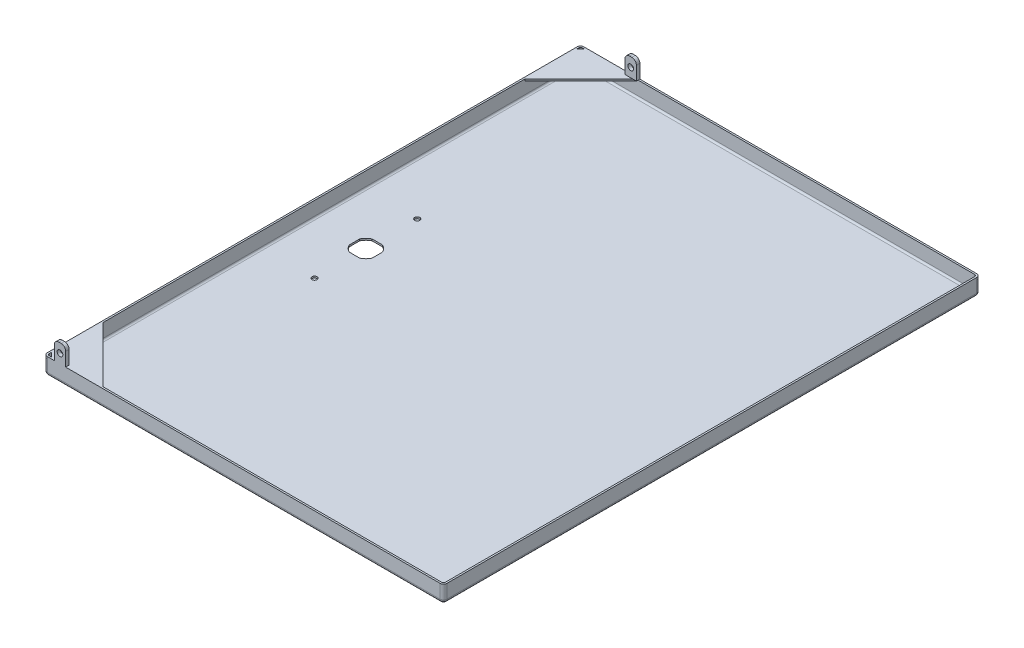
ISO-10303-21;
HEADER;
FILE_DESCRIPTION(('STEP AP214'),'2;1');
FILE_NAME('part.step','',(''),(''),'','','');
FILE_SCHEMA(('AUTOMOTIVE_DESIGN { 1 0 10303 214 1 1 1 1 }'));
ENDSEC;
DATA;
#1=APPLICATION_CONTEXT('core data for automotive mechanical design processes');
#2=APPLICATION_PROTOCOL_DEFINITION('international standard','automotive_design',2000,#1);
#3=PRODUCT_CONTEXT('',#1,'mechanical');
#4=PRODUCT('Part','Part','',(#3));
#5=PRODUCT_RELATED_PRODUCT_CATEGORY('part','',(#4));
#6=PRODUCT_DEFINITION_FORMATION('','',#4);
#7=PRODUCT_DEFINITION_CONTEXT('part definition',#1,'design');
#8=PRODUCT_DEFINITION('design','',#6,#7);
#9=PRODUCT_DEFINITION_SHAPE('','',#8);
#10=(LENGTH_UNIT() NAMED_UNIT(*) SI_UNIT(.MILLI.,.METRE.));
#11=(NAMED_UNIT(*) PLANE_ANGLE_UNIT() SI_UNIT($,.RADIAN.));
#12=(NAMED_UNIT(*) SI_UNIT($,.STERADIAN.) SOLID_ANGLE_UNIT());
#13=UNCERTAINTY_MEASURE_WITH_UNIT(LENGTH_MEASURE(1.E-05),#10,'distance_accuracy_value','');
#14=(GEOMETRIC_REPRESENTATION_CONTEXT(3) GLOBAL_UNCERTAINTY_ASSIGNED_CONTEXT((#13)) GLOBAL_UNIT_ASSIGNED_CONTEXT((#10,
#11,#12)) REPRESENTATION_CONTEXT('',''));
#15=CARTESIAN_POINT('',(0.,0.,0.));
#16=DIRECTION('',(0.,0.,1.));
#17=DIRECTION('',(1.,0.,0.));
#18=AXIS2_PLACEMENT_3D('',#15,#16,#17);
#19=CARTESIAN_POINT('',(-170.,6.,233.5));
#20=DIRECTION('',(-0.707106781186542,0.,0.707106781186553));
#21=DIRECTION('',(0.707106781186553,0.,0.707106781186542));
#22=AXIS2_PLACEMENT_3D('',#19,#20,#21);
#23=PLANE('',#22);
#24=DIRECTION('',(0.707106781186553,0.,0.707106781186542));
#25=VECTOR('',#24,1.);
#26=CARTESIAN_POINT('',(-170.,7.5,233.5));
#27=LINE('',#26,#25);
#28=CARTESIAN_POINT('',(-173.5,7.5,230.));
#29=VERTEX_POINT('',#28);
#30=CARTESIAN_POINT('',(-170.,7.5,233.5));
#31=VERTEX_POINT('',#30);
#32=EDGE_CURVE('E674',#29,#31,#27,.T.);
#33=ORIENTED_EDGE('',*,*,#32,.F.);
#34=DIRECTION('',(0.,1.,0.));
#35=VECTOR('',#34,1.);
#36=CARTESIAN_POINT('',(-173.5,6.,230.));
#37=LINE('',#36,#35);
#38=CARTESIAN_POINT('',(-173.5,6.,230.));
#39=VERTEX_POINT('',#38);
#40=EDGE_CURVE('E691',#39,#29,#37,.T.);
#41=ORIENTED_EDGE('',*,*,#40,.F.);
#42=DIRECTION('',(0.707106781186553,0.,0.707106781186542));
#43=VECTOR('',#42,1.);
#44=CARTESIAN_POINT('',(-170.,6.,233.5));
#45=LINE('',#44,#43);
#46=CARTESIAN_POINT('',(-170.,6.,233.5));
#47=VERTEX_POINT('',#46);
#48=EDGE_CURVE('E679',#39,#47,#45,.T.);
#49=ORIENTED_EDGE('',*,*,#48,.T.);
#50=DIRECTION('',(0.,1.,0.));
#51=VECTOR('',#50,1.);
#52=CARTESIAN_POINT('',(-170.,6.,233.5));
#53=LINE('',#52,#51);
#54=EDGE_CURVE('E687',#47,#31,#53,.T.);
#55=ORIENTED_EDGE('',*,*,#54,.T.);
#56=EDGE_LOOP('',(#33,#41,#49,#55));
#57=FACE_BOUND('',#56,.T.);
#58=ADVANCED_FACE('F16',(#57),#23,.T.);
#59=CARTESIAN_POINT('',(-173.5,6.,185.));
#60=DIRECTION('',(0.707106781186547,0.,-0.707106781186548));
#61=DIRECTION('',(-0.707106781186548,0.,-0.707106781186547));
#62=AXIS2_PLACEMENT_3D('',#59,#60,#61);
#63=PLANE('',#62);
#64=DIRECTION('',(-0.707106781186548,0.,-0.707106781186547));
#65=VECTOR('',#64,1.);
#66=CARTESIAN_POINT('',(-173.5,7.5,185.));
#67=LINE('',#66,#65);
#68=CARTESIAN_POINT('',(-125.,7.5,233.5));
#69=VERTEX_POINT('',#68);
#70=CARTESIAN_POINT('',(-173.5,7.5,185.));
#71=VERTEX_POINT('',#70);
#72=EDGE_CURVE('E668',#69,#71,#67,.T.);
#73=ORIENTED_EDGE('',*,*,#72,.F.);
#74=DIRECTION('',(0.,1.,0.));
#75=VECTOR('',#74,1.);
#76=CARTESIAN_POINT('',(-125.,6.,233.5));
#77=LINE('',#76,#75);
#78=CARTESIAN_POINT('',(-125.,6.,233.5));
#79=VERTEX_POINT('',#78);
#80=EDGE_CURVE('E682',#79,#69,#77,.T.);
#81=ORIENTED_EDGE('',*,*,#80,.F.);
#82=DIRECTION('',(-0.707106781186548,0.,-0.707106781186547));
#83=VECTOR('',#82,1.);
#84=CARTESIAN_POINT('',(-173.5,6.,185.));
#85=LINE('',#84,#83);
#86=CARTESIAN_POINT('',(-173.5,6.,185.));
#87=VERTEX_POINT('',#86);
#88=EDGE_CURVE('E673',#79,#87,#85,.T.);
#89=ORIENTED_EDGE('',*,*,#88,.T.);
#90=DIRECTION('',(0.,1.,0.));
#91=VECTOR('',#90,1.);
#92=CARTESIAN_POINT('',(-173.5,6.,185.));
#93=LINE('',#92,#91);
#94=EDGE_CURVE('E694',#87,#71,#93,.T.);
#95=ORIENTED_EDGE('',*,*,#94,.T.);
#96=EDGE_LOOP('',(#73,#81,#89,#95));
#97=FACE_BOUND('',#96,.T.);
#98=ADVANCED_FACE('F910',(#97),#63,.T.);
#99=CARTESIAN_POINT('',(-173.5,6.,233.5));
#100=DIRECTION('',(0.,1.,0.));
#101=DIRECTION('',(0.,0.,1.));
#102=AXIS2_PLACEMENT_3D('',#99,#100,#101);
#103=PLANE('',#102);
#104=DIRECTION('',(1.,0.,0.));
#105=VECTOR('',#104,1.);
#106=CARTESIAN_POINT('',(-170.,6.,233.5));
#107=LINE('',#106,#105);
#108=EDGE_CURVE('E671',#47,#79,#107,.T.);
#109=ORIENTED_EDGE('',*,*,#108,.F.);
#110=ORIENTED_EDGE('',*,*,#48,.F.);
#111=DIRECTION('',(0.,0.,1.));
#112=VECTOR('',#111,1.);
#113=CARTESIAN_POINT('',(-173.5,6.,230.));
#114=LINE('',#113,#112);
#115=EDGE_CURVE('E677',#87,#39,#114,.T.);
#116=ORIENTED_EDGE('',*,*,#115,.F.);
#117=ORIENTED_EDGE('',*,*,#88,.F.);
#118=EDGE_LOOP('',(#109,#110,#116,#117));
#119=FACE_BOUND('',#118,.T.);
#120=ADVANCED_FACE('F917',(#119),#103,.F.);
#121=CARTESIAN_POINT('',(-173.5,7.5,233.5));
#122=DIRECTION('',(0.,1.,0.));
#123=DIRECTION('',(0.,0.,1.));
#124=AXIS2_PLACEMENT_3D('',#121,#122,#123);
#125=PLANE('',#124);
#126=DIRECTION('',(0.,0.,1.));
#127=VECTOR('',#126,1.);
#128=CARTESIAN_POINT('',(-173.5,7.5,-235.));
#129=LINE('',#128,#127);
#130=CARTESIAN_POINT('',(-173.5,7.5,232.));
#131=VERTEX_POINT('',#130);
#132=EDGE_CURVE('E403',#29,#131,#129,.T.);
#133=ORIENTED_EDGE('',*,*,#132,.F.);
#134=ORIENTED_EDGE('',*,*,#32,.T.);
#135=DIRECTION('',(1.,0.,0.));
#136=VECTOR('',#135,1.);
#137=CARTESIAN_POINT('',(-175.,7.5,233.5));
#138=LINE('',#137,#136);
#139=CARTESIAN_POINT('',(-172.,7.5,233.5));
#140=VERTEX_POINT('',#139);
#141=EDGE_CURVE('E474',#140,#31,#138,.T.);
#142=ORIENTED_EDGE('',*,*,#141,.F.);
#143=CARTESIAN_POINT('',(-172.,7.5,232.));
#144=DIRECTION('',(0.,1.,0.));
#145=DIRECTION('',(0.,0.,1.));
#146=AXIS2_PLACEMENT_3D('',#143,#144,#145);
#147=CIRCLE('',#146,1.5);
#148=EDGE_CURVE('E460',#131,#140,#147,.T.);
#149=ORIENTED_EDGE('',*,*,#148,.F.);
#150=EDGE_LOOP('',(#133,#134,#142,#149));
#151=FACE_BOUND('',#150,.T.);
#152=DIRECTION('',(0.,0.,1.));
#153=VECTOR('',#152,1.);
#154=CARTESIAN_POINT('',(-166.,7.5,232.));
#155=LINE('',#154,#153);
#156=CARTESIAN_POINT('',(-166.,7.5,232.));
#157=VERTEX_POINT('',#156);
#158=CARTESIAN_POINT('',(-166.,7.5,235.));
#159=VERTEX_POINT('',#158);
#160=EDGE_CURVE('E659',#157,#159,#155,.T.);
#161=ORIENTED_EDGE('',*,*,#160,.F.);
#162=DIRECTION('',(1.,0.,0.));
#163=VECTOR('',#162,1.);
#164=CARTESIAN_POINT('',(-166.,7.5,232.));
#165=LINE('',#164,#163);
#166=CARTESIAN_POINT('',(-156.,7.5,232.));
#167=VERTEX_POINT('',#166);
#168=EDGE_CURVE('E650',#157,#167,#165,.T.);
#169=ORIENTED_EDGE('',*,*,#168,.T.);
#170=DIRECTION('',(0.,0.,1.));
#171=VECTOR('',#170,1.);
#172=CARTESIAN_POINT('',(-156.,7.5,232.));
#173=LINE('',#172,#171);
#174=CARTESIAN_POINT('',(-156.,7.5,235.));
#175=VERTEX_POINT('',#174);
#176=EDGE_CURVE('E666',#167,#175,#173,.T.);
#177=ORIENTED_EDGE('',*,*,#176,.T.);
#178=DIRECTION('',(1.,0.,0.));
#179=VECTOR('',#178,1.);
#180=CARTESIAN_POINT('',(-175.,7.5,235.));
#181=LINE('',#180,#179);
#182=CARTESIAN_POINT('',(172.,7.5,235.));
#183=VERTEX_POINT('',#182);
#184=EDGE_CURVE('E490',#175,#183,#181,.T.);
#185=ORIENTED_EDGE('',*,*,#184,.T.);
#186=CARTESIAN_POINT('',(172.,7.5,232.));
#187=DIRECTION('',(0.,1.,0.));
#188=DIRECTION('',(0.,0.,1.));
#189=AXIS2_PLACEMENT_3D('',#186,#187,#188);
#190=CIRCLE('',#189,3.);
#191=CARTESIAN_POINT('',(175.,7.5,232.));
#192=VERTEX_POINT('',#191);
#193=EDGE_CURVE('E522',#183,#192,#190,.T.);
#194=ORIENTED_EDGE('',*,*,#193,.T.);
#195=DIRECTION('',(0.,0.,-1.));
#196=VECTOR('',#195,1.);
#197=CARTESIAN_POINT('',(175.,7.5,-235.));
#198=LINE('',#197,#196);
#199=CARTESIAN_POINT('',(175.,7.5,-232.));
#200=VERTEX_POINT('',#199);
#201=EDGE_CURVE('E495',#192,#200,#198,.T.);
#202=ORIENTED_EDGE('',*,*,#201,.T.);
#203=CARTESIAN_POINT('',(172.,7.5,-232.));
#204=DIRECTION('',(0.,1.,0.));
#205=DIRECTION('',(0.,0.,1.));
#206=AXIS2_PLACEMENT_3D('',#203,#204,#205);
#207=CIRCLE('',#206,3.);
#208=CARTESIAN_POINT('',(172.,7.5,-235.));
#209=VERTEX_POINT('',#208);
#210=EDGE_CURVE('E520',#200,#209,#207,.T.);
#211=ORIENTED_EDGE('',*,*,#210,.T.);
#212=DIRECTION('',(-1.,0.,0.));
#213=VECTOR('',#212,1.);
#214=CARTESIAN_POINT('',(-175.,7.5,-235.));
#215=LINE('',#214,#213);
#216=CARTESIAN_POINT('',(-123.,7.5,-235.));
#217=VERTEX_POINT('',#216);
#218=EDGE_CURVE('E499',#209,#217,#215,.T.);
#219=ORIENTED_EDGE('',*,*,#218,.T.);
#220=DIRECTION('',(0.,0.,1.));
#221=VECTOR('',#220,1.);
#222=CARTESIAN_POINT('',(-123.,7.5,-232.));
#223=LINE('',#222,#221);
#224=CARTESIAN_POINT('',(-123.,7.5,-233.5));
#225=VERTEX_POINT('',#224);
#226=EDGE_CURVE('E580',#217,#225,#223,.T.);
#227=ORIENTED_EDGE('',*,*,#226,.T.);
#228=DIRECTION('',(-1.,0.,0.));
#229=VECTOR('',#228,1.);
#230=CARTESIAN_POINT('',(-175.,7.5,-233.5));
#231=LINE('',#230,#229);
#232=CARTESIAN_POINT('',(172.,7.5,-233.5));
#233=VERTEX_POINT('',#232);
#234=EDGE_CURVE('E441',#233,#225,#231,.T.);
#235=ORIENTED_EDGE('',*,*,#234,.F.);
#236=CARTESIAN_POINT('',(172.,7.5,-232.));
#237=DIRECTION('',(0.,1.,0.));
#238=DIRECTION('',(0.,0.,1.));
#239=AXIS2_PLACEMENT_3D('',#236,#237,#238);
#240=CIRCLE('',#239,1.5);
#241=CARTESIAN_POINT('',(173.5,7.5,-232.));
#242=VERTEX_POINT('',#241);
#243=EDGE_CURVE('E478',#242,#233,#240,.T.);
#244=ORIENTED_EDGE('',*,*,#243,.F.);
#245=DIRECTION('',(0.,0.,-1.));
#246=VECTOR('',#245,1.);
#247=CARTESIAN_POINT('',(173.5,7.5,-235.));
#248=LINE('',#247,#246);
#249=CARTESIAN_POINT('',(173.5,7.5,232.));
#250=VERTEX_POINT('',#249);
#251=EDGE_CURVE('E476',#250,#242,#248,.T.);
#252=ORIENTED_EDGE('',*,*,#251,.F.);
#253=CARTESIAN_POINT('',(172.,7.5,232.));
#254=DIRECTION('',(0.,1.,0.));
#255=DIRECTION('',(0.,0.,1.));
#256=AXIS2_PLACEMENT_3D('',#253,#254,#255);
#257=CIRCLE('',#256,1.5);
#258=CARTESIAN_POINT('',(172.,7.5,233.5));
#259=VERTEX_POINT('',#258);
#260=EDGE_CURVE('E411',#259,#250,#257,.T.);
#261=ORIENTED_EDGE('',*,*,#260,.F.);
#262=EDGE_CURVE('E470',#69,#259,#138,.T.);
#263=ORIENTED_EDGE('',*,*,#262,.F.);
#264=ORIENTED_EDGE('',*,*,#72,.T.);
#265=CARTESIAN_POINT('',(-173.5,7.5,-185.));
#266=VERTEX_POINT('',#265);
#267=EDGE_CURVE('E471',#266,#71,#129,.T.);
#268=ORIENTED_EDGE('',*,*,#267,.F.);
#269=DIRECTION('',(0.707106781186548,0.,-0.707106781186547));
#270=VECTOR('',#269,1.);
#271=CARTESIAN_POINT('',(-173.5,7.5,-185.));
#272=LINE('',#271,#270);
#273=CARTESIAN_POINT('',(-126.5,7.5,-232.));
#274=VERTEX_POINT('',#273);
#275=EDGE_CURVE('E618',#266,#274,#272,.T.);
#276=ORIENTED_EDGE('',*,*,#275,.T.);
#277=DIRECTION('',(-1.,0.,0.));
#278=VECTOR('',#277,1.);
#279=CARTESIAN_POINT('',(-133.,7.5,-232.));
#280=LINE('',#279,#278);
#281=CARTESIAN_POINT('',(-133.,7.5,-232.));
#282=VERTEX_POINT('',#281);
#283=EDGE_CURVE('E602',#274,#282,#280,.T.);
#284=ORIENTED_EDGE('',*,*,#283,.T.);
#285=DIRECTION('',(0.,0.,-1.));
#286=VECTOR('',#285,1.);
#287=CARTESIAN_POINT('',(-133.,7.5,-232.));
#288=LINE('',#287,#286);
#289=CARTESIAN_POINT('',(-133.,7.5,-235.));
#290=VERTEX_POINT('',#289);
#291=EDGE_CURVE('E609',#282,#290,#288,.T.);
#292=ORIENTED_EDGE('',*,*,#291,.T.);
#293=CARTESIAN_POINT('',(-172.,7.5,-235.));
#294=VERTEX_POINT('',#293);
#295=EDGE_CURVE('E498',#290,#294,#215,.T.);
#296=ORIENTED_EDGE('',*,*,#295,.T.);
#297=CARTESIAN_POINT('',(-172.,7.5,-232.));
#298=DIRECTION('',(0.,1.,0.));
#299=DIRECTION('',(0.,0.,1.));
#300=AXIS2_PLACEMENT_3D('',#297,#298,#299);
#301=CIRCLE('',#300,3.);
#302=CARTESIAN_POINT('',(-175.,7.5,-232.));
#303=VERTEX_POINT('',#302);
#304=EDGE_CURVE('E518',#294,#303,#301,.T.);
#305=ORIENTED_EDGE('',*,*,#304,.T.);
#306=DIRECTION('',(0.,0.,1.));
#307=VECTOR('',#306,1.);
#308=CARTESIAN_POINT('',(-175.,7.5,-235.));
#309=LINE('',#308,#307);
#310=CARTESIAN_POINT('',(-175.,7.5,232.));
#311=VERTEX_POINT('',#310);
#312=EDGE_CURVE('E487',#303,#311,#309,.T.);
#313=ORIENTED_EDGE('',*,*,#312,.T.);
#314=CARTESIAN_POINT('',(-172.,7.5,232.));
#315=DIRECTION('',(0.,1.,0.));
#316=DIRECTION('',(0.,0.,1.));
#317=AXIS2_PLACEMENT_3D('',#314,#315,#316);
#318=CIRCLE('',#317,3.);
#319=CARTESIAN_POINT('',(-172.,7.5,235.));
#320=VERTEX_POINT('',#319);
#321=EDGE_CURVE('E516',#311,#320,#318,.T.);
#322=ORIENTED_EDGE('',*,*,#321,.T.);
#323=EDGE_CURVE('E492',#320,#159,#181,.T.);
#324=ORIENTED_EDGE('',*,*,#323,.T.);
#325=EDGE_LOOP('',(#161,#169,#177,#185,#194,#202,#211,#219,#227,#235,#244,#252,#261,#263,#264,
#268,#276,#284,#292,#296,#305,#313,#322,#324));
#326=FACE_BOUND('',#325,.T.);
#327=CARTESIAN_POINT('',(-170.,7.5,-233.5));
#328=VERTEX_POINT('',#327);
#329=CARTESIAN_POINT('',(-172.,7.5,-233.5));
#330=VERTEX_POINT('',#329);
#331=EDGE_CURVE('E481',#328,#330,#231,.T.);
#332=ORIENTED_EDGE('',*,*,#331,.F.);
#333=DIRECTION('',(-0.707106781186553,0.,0.707106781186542));
#334=VECTOR('',#333,1.);
#335=CARTESIAN_POINT('',(-170.,7.5,-233.5));
#336=LINE('',#335,#334);
#337=CARTESIAN_POINT('',(-173.5,7.5,-230.));
#338=VERTEX_POINT('',#337);
#339=EDGE_CURVE('E611',#328,#338,#336,.T.);
#340=ORIENTED_EDGE('',*,*,#339,.T.);
#341=CARTESIAN_POINT('',(-173.5,7.5,-232.));
#342=VERTEX_POINT('',#341);
#343=EDGE_CURVE('E467',#342,#338,#129,.T.);
#344=ORIENTED_EDGE('',*,*,#343,.F.);
#345=CARTESIAN_POINT('',(-172.,7.5,-232.));
#346=DIRECTION('',(0.,1.,0.));
#347=DIRECTION('',(0.,0.,1.));
#348=AXIS2_PLACEMENT_3D('',#345,#346,#347);
#349=CIRCLE('',#348,1.5);
#350=EDGE_CURVE('E473',#330,#342,#349,.T.);
#351=ORIENTED_EDGE('',*,*,#350,.F.);
#352=EDGE_LOOP('',(#332,#340,#344,#351));
#353=FACE_BOUND('',#352,.T.);
#354=ADVANCED_FACE('F750',(#151,#326,#353),#125,.T.);
#355=CARTESIAN_POINT('',(-166.,7.5,232.));
#356=DIRECTION('',(-1.,0.,0.));
#357=DIRECTION('',(0.,0.,1.));
#358=AXIS2_PLACEMENT_3D('',#355,#356,#357);
#359=PLANE('',#358);
#360=DIRECTION('',(0.,-1.,0.));
#361=VECTOR('',#360,1.);
#362=CARTESIAN_POINT('',(-166.,7.5,235.));
#363=LINE('',#362,#361);
#364=CARTESIAN_POINT('',(-166.,19.5,235.));
#365=VERTEX_POINT('',#364);
#366=EDGE_CURVE('E644',#365,#159,#363,.T.);
#367=ORIENTED_EDGE('',*,*,#366,.F.);
#368=DIRECTION('',(0.,0.,1.));
#369=VECTOR('',#368,1.);
#370=CARTESIAN_POINT('',(-166.,19.5,232.));
#371=LINE('',#370,#369);
#372=CARTESIAN_POINT('',(-166.,19.5,232.));
#373=VERTEX_POINT('',#372);
#374=EDGE_CURVE('E11',#365,#373,#371,.F.);
#375=ORIENTED_EDGE('',*,*,#374,.T.);
#376=DIRECTION('',(0.,-1.,0.));
#377=VECTOR('',#376,1.);
#378=CARTESIAN_POINT('',(-166.,7.5,232.));
#379=LINE('',#378,#377);
#380=EDGE_CURVE('E648',#373,#157,#379,.T.);
#381=ORIENTED_EDGE('',*,*,#380,.T.);
#382=ORIENTED_EDGE('',*,*,#160,.T.);
#383=EDGE_LOOP('',(#367,#375,#381,#382));
#384=FACE_BOUND('',#383,.T.);
#385=ADVANCED_FACE('F747',(#384),#359,.T.);
#386=CARTESIAN_POINT('',(-166.,23.5,232.));
#387=DIRECTION('',(0.,1.,0.));
#388=DIRECTION('',(-1.,0.,0.));
#389=AXIS2_PLACEMENT_3D('',#386,#387,#388);
#390=PLANE('',#389);
#391=DIRECTION('',(-1.,0.,0.));
#392=VECTOR('',#391,1.);
#393=CARTESIAN_POINT('',(-166.,23.5,235.));
#394=LINE('',#393,#392);
#395=CARTESIAN_POINT('',(-160.,23.5,235.));
#396=VERTEX_POINT('',#395);
#397=CARTESIAN_POINT('',(-162.,23.5,235.));
#398=VERTEX_POINT('',#397);
#399=EDGE_CURVE('E651',#396,#398,#394,.T.);
#400=ORIENTED_EDGE('',*,*,#399,.F.);
#401=DIRECTION('',(0.,0.,1.));
#402=VECTOR('',#401,1.);
#403=CARTESIAN_POINT('',(-160.,23.5,232.));
#404=LINE('',#403,#402);
#405=CARTESIAN_POINT('',(-160.,23.5,232.));
#406=VERTEX_POINT('',#405);
#407=EDGE_CURVE('E725',#396,#406,#404,.F.);
#408=ORIENTED_EDGE('',*,*,#407,.T.);
#409=DIRECTION('',(-1.,0.,0.));
#410=VECTOR('',#409,1.);
#411=CARTESIAN_POINT('',(-166.,23.5,232.));
#412=LINE('',#411,#410);
#413=CARTESIAN_POINT('',(-162.,23.5,232.));
#414=VERTEX_POINT('',#413);
#415=EDGE_CURVE('E657',#406,#414,#412,.T.);
#416=ORIENTED_EDGE('',*,*,#415,.T.);
#417=DIRECTION('',(0.,0.,1.));
#418=VECTOR('',#417,1.);
#419=CARTESIAN_POINT('',(-162.,23.5,232.));
#420=LINE('',#419,#418);
#421=EDGE_CURVE('E722',#414,#398,#420,.T.);
#422=ORIENTED_EDGE('',*,*,#421,.T.);
#423=EDGE_LOOP('',(#400,#408,#416,#422));
#424=FACE_BOUND('',#423,.T.);
#425=ADVANCED_FACE('F743',(#424),#390,.T.);
#426=CARTESIAN_POINT('',(-156.,7.5,232.));
#427=DIRECTION('',(1.,0.,0.));
#428=DIRECTION('',(0.,0.,-1.));
#429=AXIS2_PLACEMENT_3D('',#426,#427,#428);
#430=PLANE('',#429);
#431=DIRECTION('',(0.,1.,0.));
#432=VECTOR('',#431,1.);
#433=CARTESIAN_POINT('',(-156.,7.5,232.));
#434=LINE('',#433,#432);
#435=CARTESIAN_POINT('',(-156.,19.5,232.));
#436=VERTEX_POINT('',#435);
#437=EDGE_CURVE('E654',#167,#436,#434,.T.);
#438=ORIENTED_EDGE('',*,*,#437,.T.);
#439=DIRECTION('',(0.,0.,1.));
#440=VECTOR('',#439,1.);
#441=CARTESIAN_POINT('',(-156.,19.5,232.));
#442=LINE('',#441,#440);
#443=CARTESIAN_POINT('',(-156.,19.5,235.));
#444=VERTEX_POINT('',#443);
#445=EDGE_CURVE('E715',#436,#444,#442,.T.);
#446=ORIENTED_EDGE('',*,*,#445,.T.);
#447=DIRECTION('',(0.,1.,0.));
#448=VECTOR('',#447,1.);
#449=CARTESIAN_POINT('',(-156.,7.5,235.));
#450=LINE('',#449,#448);
#451=EDGE_CURVE('E661',#175,#444,#450,.T.);
#452=ORIENTED_EDGE('',*,*,#451,.F.);
#453=ORIENTED_EDGE('',*,*,#176,.F.);
#454=EDGE_LOOP('',(#438,#446,#452,#453));
#455=FACE_BOUND('',#454,.T.);
#456=ADVANCED_FACE('F735',(#455),#430,.T.);
#457=CARTESIAN_POINT('',(0.,0.,232.));
#458=DIRECTION('',(0.,0.,-1.));
#459=DIRECTION('',(-1.,0.,0.));
#460=AXIS2_PLACEMENT_3D('',#457,#458,#459);
#461=PLANE('',#460);
#462=CARTESIAN_POINT('',(-161.,15.5,232.));
#463=DIRECTION('',(0.,0.,1.));
#464=DIRECTION('',(1.,0.,0.));
#465=AXIS2_PLACEMENT_3D('',#462,#463,#464);
#466=CIRCLE('',#465,2.5);
#467=CARTESIAN_POINT('',(-158.5,15.5,232.));
#468=VERTEX_POINT('',#467);
#469=EDGE_CURVE('E641',#468,#468,#466,.T.);
#470=ORIENTED_EDGE('',*,*,#469,.T.);
#471=EDGE_LOOP('',(#470));
#472=FACE_BOUND('',#471,.T.);
#473=ORIENTED_EDGE('',*,*,#415,.F.);
#474=CARTESIAN_POINT('',(-160.,19.5,232.));
#475=DIRECTION('',(0.,0.,-1.));
#476=DIRECTION('',(-1.,0.,0.));
#477=AXIS2_PLACEMENT_3D('',#474,#475,#476);
#478=CIRCLE('',#477,4.);
#479=EDGE_CURVE('E24',#406,#436,#478,.T.);
#480=ORIENTED_EDGE('',*,*,#479,.T.);
#481=ORIENTED_EDGE('',*,*,#437,.F.);
#482=ORIENTED_EDGE('',*,*,#168,.F.);
#483=ORIENTED_EDGE('',*,*,#380,.F.);
#484=CARTESIAN_POINT('',(-162.,19.5,232.));
#485=DIRECTION('',(0.,0.,-1.));
#486=DIRECTION('',(-1.,0.,0.));
#487=AXIS2_PLACEMENT_3D('',#484,#485,#486);
#488=CIRCLE('',#487,4.);
#489=EDGE_CURVE('E36',#373,#414,#488,.T.);
#490=ORIENTED_EDGE('',*,*,#489,.T.);
#491=EDGE_LOOP('',(#473,#480,#481,#482,#483,#490));
#492=FACE_BOUND('',#491,.T.);
#493=ADVANCED_FACE('F729',(#472,#492),#461,.T.);
#494=CARTESIAN_POINT('',(0.,0.,235.));
#495=DIRECTION('',(0.,0.,-1.));
#496=DIRECTION('',(-1.,0.,0.));
#497=AXIS2_PLACEMENT_3D('',#494,#495,#496);
#498=PLANE('',#497);
#499=CARTESIAN_POINT('',(-161.,15.5,235.));
#500=DIRECTION('',(0.,0.,1.));
#501=DIRECTION('',(1.,0.,0.));
#502=AXIS2_PLACEMENT_3D('',#499,#500,#501);
#503=CIRCLE('',#502,2.5);
#504=CARTESIAN_POINT('',(-158.5,15.5,235.));
#505=VERTEX_POINT('',#504);
#506=EDGE_CURVE('E645',#505,#505,#503,.T.);
#507=ORIENTED_EDGE('',*,*,#506,.F.);
#508=EDGE_LOOP('',(#507));
#509=FACE_BOUND('',#508,.T.);
#510=ORIENTED_EDGE('',*,*,#451,.T.);
#511=CARTESIAN_POINT('',(-160.,19.5,235.));
#512=DIRECTION('',(0.,0.,-1.));
#513=DIRECTION('',(-1.,0.,0.));
#514=AXIS2_PLACEMENT_3D('',#511,#512,#513);
#515=CIRCLE('',#514,4.);
#516=EDGE_CURVE('E720',#444,#396,#515,.F.);
#517=ORIENTED_EDGE('',*,*,#516,.T.);
#518=ORIENTED_EDGE('',*,*,#399,.T.);
#519=CARTESIAN_POINT('',(-162.,19.5,235.));
#520=DIRECTION('',(0.,0.,-1.));
#521=DIRECTION('',(-1.,0.,0.));
#522=AXIS2_PLACEMENT_3D('',#519,#520,#521);
#523=CIRCLE('',#522,4.);
#524=EDGE_CURVE('E718',#398,#365,#523,.F.);
#525=ORIENTED_EDGE('',*,*,#524,.T.);
#526=ORIENTED_EDGE('',*,*,#366,.T.);
#527=ORIENTED_EDGE('',*,*,#323,.F.);
#528=DIRECTION('',(0.,-1.,0.));
#529=VECTOR('',#528,1.);
#530=CARTESIAN_POINT('',(-172.,7.5,235.));
#531=LINE('',#530,#529);
#532=CARTESIAN_POINT('',(-172.,-4.5,235.));
#533=VERTEX_POINT('',#532);
#534=EDGE_CURVE('E511',#320,#533,#531,.T.);
#535=ORIENTED_EDGE('',*,*,#534,.T.);
#536=DIRECTION('',(1.,0.,0.));
#537=VECTOR('',#536,1.);
#538=CARTESIAN_POINT('',(-175.,-4.5,235.));
#539=LINE('',#538,#537);
#540=CARTESIAN_POINT('',(172.,-4.5,235.));
#541=VERTEX_POINT('',#540);
#542=EDGE_CURVE('E509',#533,#541,#539,.T.);
#543=ORIENTED_EDGE('',*,*,#542,.T.);
#544=DIRECTION('',(0.,-1.,0.));
#545=VECTOR('',#544,1.);
#546=CARTESIAN_POINT('',(172.,7.5,235.));
#547=LINE('',#546,#545);
#548=EDGE_CURVE('E513',#541,#183,#547,.F.);
#549=ORIENTED_EDGE('',*,*,#548,.T.);
#550=ORIENTED_EDGE('',*,*,#184,.F.);
#551=EDGE_LOOP('',(#510,#517,#518,#525,#526,#527,#535,#543,#549,#550));
#552=FACE_BOUND('',#551,.T.);
#553=ADVANCED_FACE('F740',(#509,#552),#498,.F.);
#554=CARTESIAN_POINT('',(-161.,15.5,232.));
#555=DIRECTION('',(0.,0.,1.));
#556=DIRECTION('',(1.,0.,0.));
#557=AXIS2_PLACEMENT_3D('',#554,#555,#556);
#558=CYLINDRICAL_SURFACE('',#557,2.5);
#559=ORIENTED_EDGE('',*,*,#469,.F.);
#560=EDGE_LOOP('',(#559));
#561=FACE_BOUND('',#560,.T.);
#562=ORIENTED_EDGE('',*,*,#506,.T.);
#563=EDGE_LOOP('',(#562));
#564=FACE_BOUND('',#563,.T.);
#565=ADVANCED_FACE('F1497',(#561,#564),#558,.F.);
#566=CARTESIAN_POINT('',(-170.,6.,-233.5));
#567=DIRECTION('',(-0.707106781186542,0.,-0.707106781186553));
#568=DIRECTION('',(-0.707106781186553,0.,0.707106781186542));
#569=AXIS2_PLACEMENT_3D('',#566,#567,#568);
#570=PLANE('',#569);
#571=ORIENTED_EDGE('',*,*,#339,.F.);
#572=DIRECTION('',(0.,1.,0.));
#573=VECTOR('',#572,1.);
#574=CARTESIAN_POINT('',(-170.,6.,-233.5));
#575=LINE('',#574,#573);
#576=CARTESIAN_POINT('',(-170.,6.,-233.5));
#577=VERTEX_POINT('',#576);
#578=EDGE_CURVE('E632',#577,#328,#575,.T.);
#579=ORIENTED_EDGE('',*,*,#578,.F.);
#580=DIRECTION('',(-0.707106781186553,0.,0.707106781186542));
#581=VECTOR('',#580,1.);
#582=CARTESIAN_POINT('',(-170.,6.,-233.5));
#583=LINE('',#582,#581);
#584=CARTESIAN_POINT('',(-173.5,6.,-230.));
#585=VERTEX_POINT('',#584);
#586=EDGE_CURVE('E614',#577,#585,#583,.T.);
#587=ORIENTED_EDGE('',*,*,#586,.T.);
#588=DIRECTION('',(0.,1.,0.));
#589=VECTOR('',#588,1.);
#590=CARTESIAN_POINT('',(-173.5,6.,-230.));
#591=LINE('',#590,#589);
#592=EDGE_CURVE('E626',#585,#338,#591,.T.);
#593=ORIENTED_EDGE('',*,*,#592,.T.);
#594=EDGE_LOOP('',(#571,#579,#587,#593));
#595=FACE_BOUND('',#594,.T.);
#596=ADVANCED_FACE('F1487',(#595),#570,.T.);
#597=CARTESIAN_POINT('',(-173.5,6.,-185.));
#598=DIRECTION('',(0.707106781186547,0.,0.707106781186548));
#599=DIRECTION('',(0.707106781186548,0.,-0.707106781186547));
#600=AXIS2_PLACEMENT_3D('',#597,#598,#599);
#601=PLANE('',#600);
#602=ORIENTED_EDGE('',*,*,#275,.F.);
#603=DIRECTION('',(0.,1.,0.));
#604=VECTOR('',#603,1.);
#605=CARTESIAN_POINT('',(-173.5,6.,-185.));
#606=LINE('',#605,#604);
#607=CARTESIAN_POINT('',(-173.5,6.,-185.));
#608=VERTEX_POINT('',#607);
#609=EDGE_CURVE('E637',#608,#266,#606,.T.);
#610=ORIENTED_EDGE('',*,*,#609,.F.);
#611=DIRECTION('',(0.707106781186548,0.,-0.707106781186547));
#612=VECTOR('',#611,1.);
#613=CARTESIAN_POINT('',(-173.5,6.,-185.));
#614=LINE('',#613,#612);
#615=CARTESIAN_POINT('',(-125.,6.,-233.5));
#616=VERTEX_POINT('',#615);
#617=EDGE_CURVE('E621',#608,#616,#614,.T.);
#618=ORIENTED_EDGE('',*,*,#617,.T.);
#619=DIRECTION('',(0.,1.,0.));
#620=VECTOR('',#619,1.);
#621=CARTESIAN_POINT('',(-125.,6.,-233.5));
#622=LINE('',#621,#620);
#623=CARTESIAN_POINT('',(-125.,7.5,-233.5));
#624=VERTEX_POINT('',#623);
#625=EDGE_CURVE('E634',#616,#624,#622,.T.);
#626=ORIENTED_EDGE('',*,*,#625,.T.);
#627=EDGE_CURVE('E629',#274,#624,#272,.T.);
#628=ORIENTED_EDGE('',*,*,#627,.F.);
#629=EDGE_LOOP('',(#602,#610,#618,#626,#628));
#630=FACE_BOUND('',#629,.T.);
#631=ADVANCED_FACE('F1477',(#630),#601,.T.);
#632=CARTESIAN_POINT('',(-173.5,6.,-230.));
#633=DIRECTION('',(0.,1.,0.));
#634=DIRECTION('',(0.,0.,1.));
#635=AXIS2_PLACEMENT_3D('',#632,#633,#634);
#636=PLANE('',#635);
#637=ORIENTED_EDGE('',*,*,#586,.F.);
#638=DIRECTION('',(-1.,0.,0.));
#639=VECTOR('',#638,1.);
#640=CARTESIAN_POINT('',(-170.,6.,-233.5));
#641=LINE('',#640,#639);
#642=EDGE_CURVE('E624',#616,#577,#641,.T.);
#643=ORIENTED_EDGE('',*,*,#642,.F.);
#644=ORIENTED_EDGE('',*,*,#617,.F.);
#645=DIRECTION('',(0.,0.,1.));
#646=VECTOR('',#645,1.);
#647=CARTESIAN_POINT('',(-173.5,6.,-230.));
#648=LINE('',#647,#646);
#649=EDGE_CURVE('E617',#585,#608,#648,.T.);
#650=ORIENTED_EDGE('',*,*,#649,.F.);
#651=EDGE_LOOP('',(#637,#643,#644,#650));
#652=FACE_BOUND('',#651,.T.);
#653=ADVANCED_FACE('F1468',(#652),#636,.F.);
#654=CARTESIAN_POINT('',(-133.,7.5,-232.));
#655=DIRECTION('',(-1.,0.,0.));
#656=DIRECTION('',(0.,-1.,0.));
#657=AXIS2_PLACEMENT_3D('',#654,#655,#656);
#658=PLANE('',#657);
#659=DIRECTION('',(0.,1.,0.));
#660=VECTOR('',#659,1.);
#661=CARTESIAN_POINT('',(-133.,7.5,-232.));
#662=LINE('',#661,#660);
#663=CARTESIAN_POINT('',(-133.,19.5,-232.));
#664=VERTEX_POINT('',#663);
#665=EDGE_CURVE('E589',#282,#664,#662,.T.);
#666=ORIENTED_EDGE('',*,*,#665,.T.);
#667=DIRECTION('',(0.,0.,-1.));
#668=VECTOR('',#667,1.);
#669=CARTESIAN_POINT('',(-133.,19.5,-232.));
#670=LINE('',#669,#668);
#671=CARTESIAN_POINT('',(-133.,19.5,-235.));
#672=VERTEX_POINT('',#671);
#673=EDGE_CURVE('E690',#664,#672,#670,.T.);
#674=ORIENTED_EDGE('',*,*,#673,.T.);
#675=DIRECTION('',(0.,1.,0.));
#676=VECTOR('',#675,1.);
#677=CARTESIAN_POINT('',(-133.,7.5,-235.));
#678=LINE('',#677,#676);
#679=EDGE_CURVE('E586',#290,#672,#678,.T.);
#680=ORIENTED_EDGE('',*,*,#679,.F.);
#681=ORIENTED_EDGE('',*,*,#291,.F.);
#682=EDGE_LOOP('',(#666,#674,#680,#681));
#683=FACE_BOUND('',#682,.T.);
#684=ADVANCED_FACE('F821',(#683),#658,.T.);
#685=CARTESIAN_POINT('',(-133.,7.5,-232.));
#686=DIRECTION('',(0.,-1.,0.));
#687=DIRECTION('',(0.,0.,-1.));
#688=AXIS2_PLACEMENT_3D('',#685,#686,#687);
#689=PLANE('',#688);
#690=EDGE_CURVE('E485',#225,#624,#231,.T.);
#691=ORIENTED_EDGE('',*,*,#690,.F.);
#692=DIRECTION('',(0.,0.,-1.));
#693=VECTOR('',#692,1.);
#694=CARTESIAN_POINT('',(-123.,7.5,-232.));
#695=LINE('',#694,#693);
#696=CARTESIAN_POINT('',(-123.,7.5,-232.));
#697=VERTEX_POINT('',#696);
#698=EDGE_CURVE('E601',#697,#225,#695,.T.);
#699=ORIENTED_EDGE('',*,*,#698,.F.);
#700=EDGE_CURVE('E598',#697,#274,#280,.T.);
#701=ORIENTED_EDGE('',*,*,#700,.T.);
#702=ORIENTED_EDGE('',*,*,#627,.T.);
#703=EDGE_LOOP('',(#691,#699,#701,#702));
#704=FACE_BOUND('',#703,.T.);
#705=ADVANCED_FACE('F852',(#704),#689,.T.);
#706=CARTESIAN_POINT('',(-123.,7.5,-232.));
#707=DIRECTION('',(1.,0.,0.));
#708=DIRECTION('',(0.,1.,0.));
#709=AXIS2_PLACEMENT_3D('',#706,#707,#708);
#710=PLANE('',#709);
#711=DIRECTION('',(0.,-1.,0.));
#712=VECTOR('',#711,1.);
#713=CARTESIAN_POINT('',(-123.,7.5,-235.));
#714=LINE('',#713,#712);
#715=CARTESIAN_POINT('',(-123.,19.5,-235.));
#716=VERTEX_POINT('',#715);
#717=EDGE_CURVE('E593',#716,#217,#714,.T.);
#718=ORIENTED_EDGE('',*,*,#717,.F.);
#719=DIRECTION('',(0.,0.,-1.));
#720=VECTOR('',#719,1.);
#721=CARTESIAN_POINT('',(-123.,19.5,-232.));
#722=LINE('',#721,#720);
#723=CARTESIAN_POINT('',(-123.,19.5,-232.));
#724=VERTEX_POINT('',#723);
#725=EDGE_CURVE('E713',#716,#724,#722,.F.);
#726=ORIENTED_EDGE('',*,*,#725,.T.);
#727=DIRECTION('',(0.,-1.,0.));
#728=VECTOR('',#727,1.);
#729=CARTESIAN_POINT('',(-123.,7.5,-232.));
#730=LINE('',#729,#728);
#731=EDGE_CURVE('E596',#724,#697,#730,.T.);
#732=ORIENTED_EDGE('',*,*,#731,.T.);
#733=ORIENTED_EDGE('',*,*,#698,.T.);
#734=ORIENTED_EDGE('',*,*,#226,.F.);
#735=EDGE_LOOP('',(#718,#726,#732,#733,#734));
#736=FACE_BOUND('',#735,.T.);
#737=ADVANCED_FACE('F840',(#736),#710,.T.);
#738=CARTESIAN_POINT('',(-133.,23.5,-232.));
#739=DIRECTION('',(0.,1.,0.));
#740=DIRECTION('',(-1.,0.,0.));
#741=AXIS2_PLACEMENT_3D('',#738,#739,#740);
#742=PLANE('',#741);
#743=DIRECTION('',(1.,0.,0.));
#744=VECTOR('',#743,1.);
#745=CARTESIAN_POINT('',(-133.,23.5,-235.));
#746=LINE('',#745,#744);
#747=CARTESIAN_POINT('',(-129.,23.5,-235.));
#748=VERTEX_POINT('',#747);
#749=CARTESIAN_POINT('',(-127.,23.5,-235.));
#750=VERTEX_POINT('',#749);
#751=EDGE_CURVE('E605',#748,#750,#746,.T.);
#752=ORIENTED_EDGE('',*,*,#751,.F.);
#753=DIRECTION('',(0.,0.,-1.));
#754=VECTOR('',#753,1.);
#755=CARTESIAN_POINT('',(-129.,23.5,-232.));
#756=LINE('',#755,#754);
#757=CARTESIAN_POINT('',(-129.,23.5,-232.));
#758=VERTEX_POINT('',#757);
#759=EDGE_CURVE('E707',#748,#758,#756,.F.);
#760=ORIENTED_EDGE('',*,*,#759,.T.);
#761=DIRECTION('',(1.,0.,0.));
#762=VECTOR('',#761,1.);
#763=CARTESIAN_POINT('',(-133.,23.5,-232.));
#764=LINE('',#763,#762);
#765=CARTESIAN_POINT('',(-127.,23.5,-232.));
#766=VERTEX_POINT('',#765);
#767=EDGE_CURVE('E592',#758,#766,#764,.T.);
#768=ORIENTED_EDGE('',*,*,#767,.T.);
#769=DIRECTION('',(0.,0.,-1.));
#770=VECTOR('',#769,1.);
#771=CARTESIAN_POINT('',(-127.,23.5,-232.));
#772=LINE('',#771,#770);
#773=EDGE_CURVE('E704',#766,#750,#772,.T.);
#774=ORIENTED_EDGE('',*,*,#773,.T.);
#775=EDGE_LOOP('',(#752,#760,#768,#774));
#776=FACE_BOUND('',#775,.T.);
#777=ADVANCED_FACE('F830',(#776),#742,.T.);
#778=CARTESIAN_POINT('',(0.,0.,-232.));
#779=DIRECTION('',(0.,0.,-1.));
#780=DIRECTION('',(-1.,0.,0.));
#781=AXIS2_PLACEMENT_3D('',#778,#779,#780);
#782=PLANE('',#781);
#783=CARTESIAN_POINT('',(-128.,15.5,-232.));
#784=DIRECTION('',(0.,0.,-1.));
#785=DIRECTION('',(-1.,0.,0.));
#786=AXIS2_PLACEMENT_3D('',#783,#784,#785);
#787=CIRCLE('',#786,2.5);
#788=CARTESIAN_POINT('',(-130.5,15.5,-232.));
#789=VERTEX_POINT('',#788);
#790=EDGE_CURVE('E583',#789,#789,#787,.T.);
#791=ORIENTED_EDGE('',*,*,#790,.T.);
#792=EDGE_LOOP('',(#791));
#793=FACE_BOUND('',#792,.T.);
#794=ORIENTED_EDGE('',*,*,#767,.F.);
#795=CARTESIAN_POINT('',(-129.,19.5,-232.));
#796=DIRECTION('',(0.,0.,-1.));
#797=DIRECTION('',(-1.,0.,0.));
#798=AXIS2_PLACEMENT_3D('',#795,#796,#797);
#799=CIRCLE('',#798,4.);
#800=EDGE_CURVE('E711',#758,#664,#799,.F.);
#801=ORIENTED_EDGE('',*,*,#800,.T.);
#802=ORIENTED_EDGE('',*,*,#665,.F.);
#803=ORIENTED_EDGE('',*,*,#283,.F.);
#804=ORIENTED_EDGE('',*,*,#700,.F.);
#805=ORIENTED_EDGE('',*,*,#731,.F.);
#806=CARTESIAN_POINT('',(-127.,19.5,-232.));
#807=DIRECTION('',(0.,0.,-1.));
#808=DIRECTION('',(-1.,0.,0.));
#809=AXIS2_PLACEMENT_3D('',#806,#807,#808);
#810=CIRCLE('',#809,4.);
#811=EDGE_CURVE('E709',#724,#766,#810,.F.);
#812=ORIENTED_EDGE('',*,*,#811,.T.);
#813=EDGE_LOOP('',(#794,#801,#802,#803,#804,#805,#812));
#814=FACE_BOUND('',#813,.T.);
#815=ADVANCED_FACE('F1425',(#793,#814),#782,.F.);
#816=CARTESIAN_POINT('',(0.,0.,-235.));
#817=DIRECTION('',(0.,0.,-1.));
#818=DIRECTION('',(-1.,0.,0.));
#819=AXIS2_PLACEMENT_3D('',#816,#817,#818);
#820=PLANE('',#819);
#821=CARTESIAN_POINT('',(-128.,15.5,-235.));
#822=DIRECTION('',(0.,0.,-1.));
#823=DIRECTION('',(-1.,0.,0.));
#824=AXIS2_PLACEMENT_3D('',#821,#822,#823);
#825=CIRCLE('',#824,2.5);
#826=CARTESIAN_POINT('',(-130.5,15.5,-235.));
#827=VERTEX_POINT('',#826);
#828=EDGE_CURVE('E582',#827,#827,#825,.T.);
#829=ORIENTED_EDGE('',*,*,#828,.F.);
#830=EDGE_LOOP('',(#829));
#831=FACE_BOUND('',#830,.T.);
#832=ORIENTED_EDGE('',*,*,#679,.T.);
#833=CARTESIAN_POINT('',(-129.,19.5,-235.));
#834=DIRECTION('',(0.,0.,-1.));
#835=DIRECTION('',(-1.,0.,0.));
#836=AXIS2_PLACEMENT_3D('',#833,#834,#835);
#837=CIRCLE('',#836,4.);
#838=EDGE_CURVE('E702',#672,#748,#837,.T.);
#839=ORIENTED_EDGE('',*,*,#838,.T.);
#840=ORIENTED_EDGE('',*,*,#751,.T.);
#841=CARTESIAN_POINT('',(-127.,19.5,-235.));
#842=DIRECTION('',(0.,0.,-1.));
#843=DIRECTION('',(-1.,0.,0.));
#844=AXIS2_PLACEMENT_3D('',#841,#842,#843);
#845=CIRCLE('',#844,4.);
#846=EDGE_CURVE('E700',#750,#716,#845,.T.);
#847=ORIENTED_EDGE('',*,*,#846,.T.);
#848=ORIENTED_EDGE('',*,*,#717,.T.);
#849=ORIENTED_EDGE('',*,*,#218,.F.);
#850=DIRECTION('',(0.,-1.,0.));
#851=VECTOR('',#850,1.);
#852=CARTESIAN_POINT('',(172.,7.5,-235.));
#853=LINE('',#852,#851);
#854=CARTESIAN_POINT('',(172.,-4.5,-235.));
#855=VERTEX_POINT('',#854);
#856=EDGE_CURVE('E529',#209,#855,#853,.T.);
#857=ORIENTED_EDGE('',*,*,#856,.T.);
#858=DIRECTION('',(-1.,0.,0.));
#859=VECTOR('',#858,1.);
#860=CARTESIAN_POINT('',(-175.,-4.5,-235.));
#861=LINE('',#860,#859);
#862=CARTESIAN_POINT('',(-172.,-4.5,-235.));
#863=VERTEX_POINT('',#862);
#864=EDGE_CURVE('E524',#855,#863,#861,.T.);
#865=ORIENTED_EDGE('',*,*,#864,.T.);
#866=DIRECTION('',(0.,-1.,0.));
#867=VECTOR('',#866,1.);
#868=CARTESIAN_POINT('',(-172.,7.5,-235.));
#869=LINE('',#868,#867);
#870=EDGE_CURVE('E526',#863,#294,#869,.F.);
#871=ORIENTED_EDGE('',*,*,#870,.T.);
#872=ORIENTED_EDGE('',*,*,#295,.F.);
#873=EDGE_LOOP('',(#832,#839,#840,#847,#848,#849,#857,#865,#871,#872));
#874=FACE_BOUND('',#873,.T.);
#875=ADVANCED_FACE('F801',(#831,#874),#820,.T.);
#876=CARTESIAN_POINT('',(-128.,15.5,-232.));
#877=DIRECTION('',(0.,0.,-1.));
#878=DIRECTION('',(-1.,0.,0.));
#879=AXIS2_PLACEMENT_3D('',#876,#877,#878);
#880=CYLINDRICAL_SURFACE('',#879,2.5);
#881=ORIENTED_EDGE('',*,*,#790,.F.);
#882=EDGE_LOOP('',(#881));
#883=FACE_BOUND('',#882,.T.);
#884=ORIENTED_EDGE('',*,*,#828,.T.);
#885=EDGE_LOOP('',(#884));
#886=FACE_BOUND('',#885,.T.);
#887=ADVANCED_FACE('F1407',(#883,#886),#880,.F.);
#888=CARTESIAN_POINT('',(-175.,-7.5,235.));
#889=DIRECTION('',(0.,1.,0.));
#890=DIRECTION('',(0.,0.,1.));
#891=AXIS2_PLACEMENT_3D('',#888,#889,#890);
#892=PLANE('',#891);
#893=DIRECTION('',(1.,0.,0.));
#894=VECTOR('',#893,1.);
#895=CARTESIAN_POINT('',(-175.,-7.5,232.));
#896=LINE('',#895,#894);
#897=CARTESIAN_POINT('',(172.,-7.5,232.));
#898=VERTEX_POINT('',#897);
#899=CARTESIAN_POINT('',(-172.,-7.5,232.));
#900=VERTEX_POINT('',#899);
#901=EDGE_CURVE('E541',#898,#900,#896,.F.);
#902=ORIENTED_EDGE('',*,*,#901,.T.);
#903=DIRECTION('',(0.,0.,1.));
#904=VECTOR('',#903,1.);
#905=CARTESIAN_POINT('',(-172.,-7.5,235.));
#906=LINE('',#905,#904);
#907=CARTESIAN_POINT('',(-172.,-7.5,-232.));
#908=VERTEX_POINT('',#907);
#909=EDGE_CURVE('E543',#900,#908,#906,.F.);
#910=ORIENTED_EDGE('',*,*,#909,.T.);
#911=DIRECTION('',(-1.,0.,0.));
#912=VECTOR('',#911,1.);
#913=CARTESIAN_POINT('',(-175.,-7.5,-232.));
#914=LINE('',#913,#912);
#915=CARTESIAN_POINT('',(172.,-7.5,-232.));
#916=VERTEX_POINT('',#915);
#917=EDGE_CURVE('E537',#908,#916,#914,.F.);
#918=ORIENTED_EDGE('',*,*,#917,.T.);
#919=DIRECTION('',(0.,0.,-1.));
#920=VECTOR('',#919,1.);
#921=CARTESIAN_POINT('',(172.,-7.5,235.));
#922=LINE('',#921,#920);
#923=EDGE_CURVE('E539',#916,#898,#922,.F.);
#924=ORIENTED_EDGE('',*,*,#923,.T.);
#925=EDGE_LOOP('',(#902,#910,#918,#924));
#926=FACE_BOUND('',#925,.T.);
#927=DIRECTION('',(1.,0.,0.));
#928=VECTOR('',#927,1.);
#929=CARTESIAN_POINT('',(-123.417424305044,-7.5,-10.));
#930=LINE('',#929,#928);
#931=CARTESIAN_POINT('',(-132.582575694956,-7.5,-10.));
#932=VERTEX_POINT('',#931);
#933=CARTESIAN_POINT('',(-123.417424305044,-7.5,-10.));
#934=VERTEX_POINT('',#933);
#935=EDGE_CURVE('E355',#932,#934,#930,.T.);
#936=ORIENTED_EDGE('',*,*,#935,.F.);
#937=CARTESIAN_POINT('',(-128.,-7.5,0.));
#938=DIRECTION('',(0.,-1.,0.));
#939=DIRECTION('',(0.,0.,-1.));
#940=AXIS2_PLACEMENT_3D('',#937,#938,#939);
#941=CIRCLE('',#940,11.);
#942=CARTESIAN_POINT('',(-138.,-7.5,-4.58257569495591));
#943=VERTEX_POINT('',#942);
#944=EDGE_CURVE('E346',#943,#932,#941,.T.);
#945=ORIENTED_EDGE('',*,*,#944,.F.);
#946=DIRECTION('',(0.,0.,-1.));
#947=VECTOR('',#946,1.);
#948=CARTESIAN_POINT('',(-138.,-7.5,-4.58257569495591));
#949=LINE('',#948,#947);
#950=CARTESIAN_POINT('',(-138.,-7.5,4.58257569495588));
#951=VERTEX_POINT('',#950);
#952=EDGE_CURVE('E347',#951,#943,#949,.T.);
#953=ORIENTED_EDGE('',*,*,#952,.F.);
#954=CARTESIAN_POINT('',(-128.,-7.5,0.));
#955=DIRECTION('',(0.,-1.,0.));
#956=DIRECTION('',(0.,0.,-1.));
#957=AXIS2_PLACEMENT_3D('',#954,#955,#956);
#958=CIRCLE('',#957,11.);
#959=CARTESIAN_POINT('',(-132.582575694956,-7.5,10.));
#960=VERTEX_POINT('',#959);
#961=EDGE_CURVE('E374',#960,#951,#958,.T.);
#962=ORIENTED_EDGE('',*,*,#961,.F.);
#963=DIRECTION('',(-1.,0.,0.));
#964=VECTOR('',#963,1.);
#965=CARTESIAN_POINT('',(-123.417424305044,-7.5,10.));
#966=LINE('',#965,#964);
#967=CARTESIAN_POINT('',(-123.417424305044,-7.5,10.));
#968=VERTEX_POINT('',#967);
#969=EDGE_CURVE('E371',#968,#960,#966,.T.);
#970=ORIENTED_EDGE('',*,*,#969,.F.);
#971=CARTESIAN_POINT('',(-128.,-7.5,0.));
#972=DIRECTION('',(0.,-1.,0.));
#973=DIRECTION('',(0.,0.,-1.));
#974=AXIS2_PLACEMENT_3D('',#971,#972,#973);
#975=CIRCLE('',#974,11.);
#976=CARTESIAN_POINT('',(-118.,-7.5,4.58257569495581));
#977=VERTEX_POINT('',#976);
#978=EDGE_CURVE('E368',#977,#968,#975,.T.);
#979=ORIENTED_EDGE('',*,*,#978,.F.);
#980=DIRECTION('',(0.,0.,1.));
#981=VECTOR('',#980,1.);
#982=CARTESIAN_POINT('',(-118.,-7.5,-4.58257569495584));
#983=LINE('',#982,#981);
#984=CARTESIAN_POINT('',(-118.,-7.5,-4.58257569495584));
#985=VERTEX_POINT('',#984);
#986=EDGE_CURVE('E365',#985,#977,#983,.T.);
#987=ORIENTED_EDGE('',*,*,#986,.F.);
#988=CARTESIAN_POINT('',(-128.,-7.5,0.));
#989=DIRECTION('',(0.,-1.,0.));
#990=DIRECTION('',(0.,0.,-1.));
#991=AXIS2_PLACEMENT_3D('',#988,#989,#990);
#992=CIRCLE('',#991,11.);
#993=EDGE_CURVE('E362',#934,#985,#992,.T.);
#994=ORIENTED_EDGE('',*,*,#993,.F.);
#995=EDGE_LOOP('',(#936,#945,#953,#962,#970,#979,#987,#994));
#996=FACE_BOUND('',#995,.T.);
#997=CARTESIAN_POINT('',(-128.,-7.5,45.));
#998=DIRECTION('',(0.,1.,0.));
#999=DIRECTION('',(0.,0.,1.));
#1000=AXIS2_PLACEMENT_3D('',#997,#998,#999);
#1001=CIRCLE('',#1000,5.);
#1002=CARTESIAN_POINT('',(-128.,-7.49999999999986,50.));
#1003=VERTEX_POINT('',#1002);
#1004=EDGE_CURVE('E1622',#1003,#1003,#1001,.T.);
#1005=ORIENTED_EDGE('',*,*,#1004,.T.);
#1006=EDGE_LOOP('',(#1005));
#1007=FACE_BOUND('',#1006,.T.);
#1008=CARTESIAN_POINT('',(-128.,-7.5,-45.));
#1009=DIRECTION('',(0.,-1.,0.));
#1010=DIRECTION('',(0.,0.,-1.));
#1011=AXIS2_PLACEMENT_3D('',#1008,#1009,#1010);
#1012=CIRCLE('',#1011,5.);
#1013=CARTESIAN_POINT('',(-128.,-7.5,-50.));
#1014=VERTEX_POINT('',#1013);
#1015=EDGE_CURVE('E546',#1014,#1014,#1012,.T.);
#1016=ORIENTED_EDGE('',*,*,#1015,.F.);
#1017=EDGE_LOOP('',(#1016));
#1018=FACE_BOUND('',#1017,.T.);
#1019=ADVANCED_FACE('F792',(#926,#996,#1007,#1018),#892,.F.);
#1020=CARTESIAN_POINT('',(-175.,7.5,-235.));
#1021=DIRECTION('',(1.,0.,0.));
#1022=DIRECTION('',(0.,0.,-1.));
#1023=AXIS2_PLACEMENT_3D('',#1020,#1021,#1022);
#1024=PLANE('',#1023);
#1025=ORIENTED_EDGE('',*,*,#312,.F.);
#1026=DIRECTION('',(0.,-1.,0.));
#1027=VECTOR('',#1026,1.);
#1028=CARTESIAN_POINT('',(-175.,7.5,-232.));
#1029=LINE('',#1028,#1027);
#1030=CARTESIAN_POINT('',(-175.,-4.5,-232.));
#1031=VERTEX_POINT('',#1030);
#1032=EDGE_CURVE('E535',#303,#1031,#1029,.T.);
#1033=ORIENTED_EDGE('',*,*,#1032,.T.);
#1034=DIRECTION('',(0.,0.,1.));
#1035=VECTOR('',#1034,1.);
#1036=CARTESIAN_POINT('',(-175.,-4.5,-235.));
#1037=LINE('',#1036,#1035);
#1038=CARTESIAN_POINT('',(-175.,-4.5,232.));
#1039=VERTEX_POINT('',#1038);
#1040=EDGE_CURVE('E531',#1031,#1039,#1037,.T.);
#1041=ORIENTED_EDGE('',*,*,#1040,.T.);
#1042=DIRECTION('',(0.,-1.,0.));
#1043=VECTOR('',#1042,1.);
#1044=CARTESIAN_POINT('',(-175.,7.5,232.));
#1045=LINE('',#1044,#1043);
#1046=EDGE_CURVE('E533',#1039,#311,#1045,.F.);
#1047=ORIENTED_EDGE('',*,*,#1046,.T.);
#1048=EDGE_LOOP('',(#1025,#1033,#1041,#1047));
#1049=FACE_BOUND('',#1048,.T.);
#1050=ADVANCED_FACE('F817',(#1049),#1024,.F.);
#1051=CARTESIAN_POINT('',(175.,7.5,-235.));
#1052=DIRECTION('',(-1.,0.,0.));
#1053=DIRECTION('',(0.,0.,1.));
#1054=AXIS2_PLACEMENT_3D('',#1051,#1052,#1053);
#1055=PLANE('',#1054);
#1056=ORIENTED_EDGE('',*,*,#201,.F.);
#1057=DIRECTION('',(0.,-1.,0.));
#1058=VECTOR('',#1057,1.);
#1059=CARTESIAN_POINT('',(175.,7.5,232.));
#1060=LINE('',#1059,#1058);
#1061=CARTESIAN_POINT('',(175.,-4.5,232.));
#1062=VERTEX_POINT('',#1061);
#1063=EDGE_CURVE('E506',#192,#1062,#1060,.T.);
#1064=ORIENTED_EDGE('',*,*,#1063,.T.);
#1065=DIRECTION('',(0.,0.,-1.));
#1066=VECTOR('',#1065,1.);
#1067=CARTESIAN_POINT('',(175.,-4.5,-235.));
#1068=LINE('',#1067,#1066);
#1069=CARTESIAN_POINT('',(175.,-4.5,-232.));
#1070=VERTEX_POINT('',#1069);
#1071=EDGE_CURVE('E502',#1062,#1070,#1068,.T.);
#1072=ORIENTED_EDGE('',*,*,#1071,.T.);
#1073=DIRECTION('',(0.,-1.,0.));
#1074=VECTOR('',#1073,1.);
#1075=CARTESIAN_POINT('',(175.,7.5,-232.));
#1076=LINE('',#1075,#1074);
#1077=EDGE_CURVE('E504',#1070,#200,#1076,.F.);
#1078=ORIENTED_EDGE('',*,*,#1077,.T.);
#1079=EDGE_LOOP('',(#1056,#1064,#1072,#1078));
#1080=FACE_BOUND('',#1079,.T.);
#1081=ADVANCED_FACE('F776',(#1080),#1055,.F.);
#1082=CARTESIAN_POINT('',(-172.,7.5,-232.));
#1083=DIRECTION('',(0.,-1.,0.));
#1084=DIRECTION('',(0.,0.,-1.));
#1085=AXIS2_PLACEMENT_3D('',#1082,#1083,#1084);
#1086=CYLINDRICAL_SURFACE('',#1085,3.);
#1087=CARTESIAN_POINT('',(-172.,-4.5,-232.));
#1088=DIRECTION('',(0.,-1.,0.));
#1089=DIRECTION('',(0.,0.,-1.));
#1090=AXIS2_PLACEMENT_3D('',#1087,#1088,#1089);
#1091=CIRCLE('',#1090,3.);
#1092=EDGE_CURVE('E491',#1031,#863,#1091,.T.);
#1093=ORIENTED_EDGE('',*,*,#1092,.F.);
#1094=ORIENTED_EDGE('',*,*,#1032,.F.);
#1095=ORIENTED_EDGE('',*,*,#304,.F.);
#1096=ORIENTED_EDGE('',*,*,#870,.F.);
#1097=EDGE_LOOP('',(#1093,#1094,#1095,#1096));
#1098=FACE_BOUND('',#1097,.T.);
#1099=ADVANCED_FACE('F807',(#1098),#1086,.T.);
#1100=CARTESIAN_POINT('',(-172.,-4.5,-232.));
#1101=DIRECTION('',(0.,0.,1.));
#1102=DIRECTION('',(1.,0.,0.));
#1103=AXIS2_PLACEMENT_3D('',#1100,#1101,#1102);
#1104=SPHERICAL_SURFACE('',#1103,3.);
#1105=CARTESIAN_POINT('',(-172.,-4.5,-232.));
#1106=DIRECTION('',(0.,0.,-1.));
#1107=DIRECTION('',(-1.,0.,0.));
#1108=AXIS2_PLACEMENT_3D('',#1105,#1106,#1107);
#1109=CIRCLE('',#1108,3.);
#1110=EDGE_CURVE('E572',#1031,#908,#1109,.F.);
#1111=ORIENTED_EDGE('',*,*,#1110,.F.);
#1112=ORIENTED_EDGE('',*,*,#1092,.T.);
#1113=CARTESIAN_POINT('',(-172.,-4.5,-232.));
#1114=DIRECTION('',(-1.,0.,0.));
#1115=DIRECTION('',(0.,0.,1.));
#1116=AXIS2_PLACEMENT_3D('',#1113,#1114,#1115);
#1117=CIRCLE('',#1116,3.);
#1118=EDGE_CURVE('E575',#908,#863,#1117,.F.);
#1119=ORIENTED_EDGE('',*,*,#1118,.F.);
#1120=EDGE_LOOP('',(#1111,#1112,#1119));
#1121=FACE_BOUND('',#1120,.T.);
#1122=ADVANCED_FACE('F811',(#1121),#1104,.T.);
#1123=CARTESIAN_POINT('',(172.,7.5,-232.));
#1124=DIRECTION('',(0.,-1.,0.));
#1125=DIRECTION('',(0.,0.,-1.));
#1126=AXIS2_PLACEMENT_3D('',#1123,#1124,#1125);
#1127=CYLINDRICAL_SURFACE('',#1126,3.);
#1128=ORIENTED_EDGE('',*,*,#210,.F.);
#1129=ORIENTED_EDGE('',*,*,#1077,.F.);
#1130=CARTESIAN_POINT('',(172.,-4.5,-232.));
#1131=DIRECTION('',(0.,-1.,0.));
#1132=DIRECTION('',(0.,0.,-1.));
#1133=AXIS2_PLACEMENT_3D('',#1130,#1131,#1132);
#1134=CIRCLE('',#1133,3.);
#1135=EDGE_CURVE('E569',#855,#1070,#1134,.T.);
#1136=ORIENTED_EDGE('',*,*,#1135,.F.);
#1137=ORIENTED_EDGE('',*,*,#856,.F.);
#1138=EDGE_LOOP('',(#1128,#1129,#1136,#1137));
#1139=FACE_BOUND('',#1138,.T.);
#1140=ADVANCED_FACE('F781',(#1139),#1127,.T.);
#1141=CARTESIAN_POINT('',(-175.,-4.5,-232.));
#1142=DIRECTION('',(-1.,0.,0.));
#1143=DIRECTION('',(0.,0.,1.));
#1144=AXIS2_PLACEMENT_3D('',#1141,#1142,#1143);
#1145=CYLINDRICAL_SURFACE('',#1144,3.);
#1146=ORIENTED_EDGE('',*,*,#1118,.T.);
#1147=ORIENTED_EDGE('',*,*,#864,.F.);
#1148=CARTESIAN_POINT('',(172.,-4.5,-232.));
#1149=DIRECTION('',(1.,0.,0.));
#1150=DIRECTION('',(0.,0.,-1.));
#1151=AXIS2_PLACEMENT_3D('',#1148,#1149,#1150);
#1152=CIRCLE('',#1151,3.);
#1153=EDGE_CURVE('E566',#916,#855,#1152,.T.);
#1154=ORIENTED_EDGE('',*,*,#1153,.F.);
#1155=ORIENTED_EDGE('',*,*,#917,.F.);
#1156=EDGE_LOOP('',(#1146,#1147,#1154,#1155));
#1157=FACE_BOUND('',#1156,.T.);
#1158=ADVANCED_FACE('F798',(#1157),#1145,.T.);
#1159=CARTESIAN_POINT('',(-172.,-4.5,-235.));
#1160=DIRECTION('',(0.,0.,1.));
#1161=DIRECTION('',(1.,0.,0.));
#1162=AXIS2_PLACEMENT_3D('',#1159,#1160,#1161);
#1163=CYLINDRICAL_SURFACE('',#1162,3.);
#1164=ORIENTED_EDGE('',*,*,#1110,.T.);
#1165=ORIENTED_EDGE('',*,*,#909,.F.);
#1166=CARTESIAN_POINT('',(-172.,-4.5,232.));
#1167=DIRECTION('',(0.,0.,1.));
#1168=DIRECTION('',(1.,0.,0.));
#1169=AXIS2_PLACEMENT_3D('',#1166,#1167,#1168);
#1170=CIRCLE('',#1169,3.);
#1171=EDGE_CURVE('E563',#1039,#900,#1170,.T.);
#1172=ORIENTED_EDGE('',*,*,#1171,.F.);
#1173=ORIENTED_EDGE('',*,*,#1040,.F.);
#1174=EDGE_LOOP('',(#1164,#1165,#1172,#1173));
#1175=FACE_BOUND('',#1174,.T.);
#1176=ADVANCED_FACE('F814',(#1175),#1163,.T.);
#1177=CARTESIAN_POINT('',(-172.,7.5,232.));
#1178=DIRECTION('',(0.,-1.,0.));
#1179=DIRECTION('',(0.,0.,-1.));
#1180=AXIS2_PLACEMENT_3D('',#1177,#1178,#1179);
#1181=CYLINDRICAL_SURFACE('',#1180,3.);
#1182=ORIENTED_EDGE('',*,*,#321,.F.);
#1183=ORIENTED_EDGE('',*,*,#1046,.F.);
#1184=CARTESIAN_POINT('',(-172.,-4.5,232.));
#1185=DIRECTION('',(0.,-1.,0.));
#1186=DIRECTION('',(0.,0.,-1.));
#1187=AXIS2_PLACEMENT_3D('',#1184,#1185,#1186);
#1188=CIRCLE('',#1187,3.);
#1189=EDGE_CURVE('E560',#533,#1039,#1188,.T.);
#1190=ORIENTED_EDGE('',*,*,#1189,.F.);
#1191=ORIENTED_EDGE('',*,*,#534,.F.);
#1192=EDGE_LOOP('',(#1182,#1183,#1190,#1191));
#1193=FACE_BOUND('',#1192,.T.);
#1194=ADVANCED_FACE('F756',(#1193),#1181,.T.);
#1195=CARTESIAN_POINT('',(172.,-4.5,-232.));
#1196=DIRECTION('',(0.,0.,1.));
#1197=DIRECTION('',(1.,0.,0.));
#1198=AXIS2_PLACEMENT_3D('',#1195,#1196,#1197);
#1199=SPHERICAL_SURFACE('',#1198,3.);
#1200=ORIENTED_EDGE('',*,*,#1153,.T.);
#1201=ORIENTED_EDGE('',*,*,#1135,.T.);
#1202=CARTESIAN_POINT('',(172.,-4.5,-232.));
#1203=DIRECTION('',(0.,0.,-1.));
#1204=DIRECTION('',(-1.,0.,0.));
#1205=AXIS2_PLACEMENT_3D('',#1202,#1203,#1204);
#1206=CIRCLE('',#1205,3.);
#1207=EDGE_CURVE('E557',#916,#1070,#1206,.F.);
#1208=ORIENTED_EDGE('',*,*,#1207,.F.);
#1209=EDGE_LOOP('',(#1200,#1201,#1208));
#1210=FACE_BOUND('',#1209,.T.);
#1211=ADVANCED_FACE('F785',(#1210),#1199,.T.);
#1212=CARTESIAN_POINT('',(-172.,-4.5,232.));
#1213=DIRECTION('',(0.,0.,1.));
#1214=DIRECTION('',(1.,0.,0.));
#1215=AXIS2_PLACEMENT_3D('',#1212,#1213,#1214);
#1216=SPHERICAL_SURFACE('',#1215,3.);
#1217=ORIENTED_EDGE('',*,*,#1189,.T.);
#1218=ORIENTED_EDGE('',*,*,#1171,.T.);
#1219=CARTESIAN_POINT('',(-172.,-4.5,232.));
#1220=DIRECTION('',(-1.,0.,0.));
#1221=DIRECTION('',(0.,0.,1.));
#1222=AXIS2_PLACEMENT_3D('',#1219,#1220,#1221);
#1223=CIRCLE('',#1222,3.);
#1224=EDGE_CURVE('E554',#533,#900,#1223,.F.);
#1225=ORIENTED_EDGE('',*,*,#1224,.F.);
#1226=EDGE_LOOP('',(#1217,#1218,#1225));
#1227=FACE_BOUND('',#1226,.T.);
#1228=ADVANCED_FACE('F762',(#1227),#1216,.T.);
#1229=CARTESIAN_POINT('',(172.,-4.5,-235.));
#1230=DIRECTION('',(0.,0.,-1.));
#1231=DIRECTION('',(-1.,0.,0.));
#1232=AXIS2_PLACEMENT_3D('',#1229,#1230,#1231);
#1233=CYLINDRICAL_SURFACE('',#1232,3.);
#1234=ORIENTED_EDGE('',*,*,#1207,.T.);
#1235=ORIENTED_EDGE('',*,*,#1071,.F.);
#1236=CARTESIAN_POINT('',(172.,-4.5,232.));
#1237=DIRECTION('',(0.,0.,1.));
#1238=DIRECTION('',(1.,0.,0.));
#1239=AXIS2_PLACEMENT_3D('',#1236,#1237,#1238);
#1240=CIRCLE('',#1239,3.);
#1241=EDGE_CURVE('E551',#898,#1062,#1240,.T.);
#1242=ORIENTED_EDGE('',*,*,#1241,.F.);
#1243=ORIENTED_EDGE('',*,*,#923,.F.);
#1244=EDGE_LOOP('',(#1234,#1235,#1242,#1243));
#1245=FACE_BOUND('',#1244,.T.);
#1246=ADVANCED_FACE('F789',(#1245),#1233,.T.);
#1247=CARTESIAN_POINT('',(-175.,-4.5,232.));
#1248=DIRECTION('',(1.,0.,0.));
#1249=DIRECTION('',(0.,0.,-1.));
#1250=AXIS2_PLACEMENT_3D('',#1247,#1248,#1249);
#1251=CYLINDRICAL_SURFACE('',#1250,3.);
#1252=ORIENTED_EDGE('',*,*,#1224,.T.);
#1253=ORIENTED_EDGE('',*,*,#901,.F.);
#1254=CARTESIAN_POINT('',(172.,-4.5,232.));
#1255=DIRECTION('',(1.,0.,0.));
#1256=DIRECTION('',(0.,0.,-1.));
#1257=AXIS2_PLACEMENT_3D('',#1254,#1255,#1256);
#1258=CIRCLE('',#1257,3.);
#1259=EDGE_CURVE('E548',#541,#898,#1258,.T.);
#1260=ORIENTED_EDGE('',*,*,#1259,.F.);
#1261=ORIENTED_EDGE('',*,*,#542,.F.);
#1262=EDGE_LOOP('',(#1252,#1253,#1260,#1261));
#1263=FACE_BOUND('',#1262,.T.);
#1264=ADVANCED_FACE('F766',(#1263),#1251,.T.);
#1265=CARTESIAN_POINT('',(172.,-4.5,232.));
#1266=DIRECTION('',(0.,0.,1.));
#1267=DIRECTION('',(1.,0.,0.));
#1268=AXIS2_PLACEMENT_3D('',#1265,#1266,#1267);
#1269=SPHERICAL_SURFACE('',#1268,3.);
#1270=ORIENTED_EDGE('',*,*,#1259,.T.);
#1271=ORIENTED_EDGE('',*,*,#1241,.T.);
#1272=CARTESIAN_POINT('',(172.,-4.5,232.));
#1273=DIRECTION('',(0.,-1.,0.));
#1274=DIRECTION('',(0.,0.,-1.));
#1275=AXIS2_PLACEMENT_3D('',#1272,#1273,#1274);
#1276=CIRCLE('',#1275,3.);
#1277=EDGE_CURVE('E424',#541,#1062,#1276,.F.);
#1278=ORIENTED_EDGE('',*,*,#1277,.F.);
#1279=EDGE_LOOP('',(#1270,#1271,#1278));
#1280=FACE_BOUND('',#1279,.T.);
#1281=ADVANCED_FACE('F1293',(#1280),#1269,.T.);
#1282=CARTESIAN_POINT('',(172.,7.5,232.));
#1283=DIRECTION('',(0.,-1.,0.));
#1284=DIRECTION('',(0.,0.,-1.));
#1285=AXIS2_PLACEMENT_3D('',#1282,#1283,#1284);
#1286=CYLINDRICAL_SURFACE('',#1285,3.);
#1287=ORIENTED_EDGE('',*,*,#193,.F.);
#1288=ORIENTED_EDGE('',*,*,#548,.F.);
#1289=ORIENTED_EDGE('',*,*,#1277,.T.);
#1290=ORIENTED_EDGE('',*,*,#1063,.F.);
#1291=EDGE_LOOP('',(#1287,#1288,#1289,#1290));
#1292=FACE_BOUND('',#1291,.T.);
#1293=ADVANCED_FACE('F772',(#1292),#1286,.T.);
#1294=CARTESIAN_POINT('',(-173.5,7.5,-235.));
#1295=DIRECTION('',(1.,0.,0.));
#1296=DIRECTION('',(0.,0.,-1.));
#1297=AXIS2_PLACEMENT_3D('',#1294,#1295,#1296);
#1298=PLANE('',#1297);
#1299=ORIENTED_EDGE('',*,*,#115,.T.);
#1300=ORIENTED_EDGE('',*,*,#40,.T.);
#1301=ORIENTED_EDGE('',*,*,#132,.T.);
#1302=DIRECTION('',(0.,1.,0.));
#1303=VECTOR('',#1302,1.);
#1304=CARTESIAN_POINT('',(-173.5,7.5,232.));
#1305=LINE('',#1304,#1303);
#1306=CARTESIAN_POINT('',(-173.5,-4.5,232.));
#1307=VERTEX_POINT('',#1306);
#1308=EDGE_CURVE('E394',#1307,#131,#1305,.T.);
#1309=ORIENTED_EDGE('',*,*,#1308,.F.);
#1310=DIRECTION('',(0.,0.,-1.));
#1311=VECTOR('',#1310,1.);
#1312=CARTESIAN_POINT('',(-173.5,-4.5,-235.));
#1313=LINE('',#1312,#1311);
#1314=CARTESIAN_POINT('',(-173.5,-4.5,-232.));
#1315=VERTEX_POINT('',#1314);
#1316=EDGE_CURVE('E395',#1315,#1307,#1313,.F.);
#1317=ORIENTED_EDGE('',*,*,#1316,.F.);
#1318=DIRECTION('',(0.,1.,0.));
#1319=VECTOR('',#1318,1.);
#1320=CARTESIAN_POINT('',(-173.5,7.5,-232.));
#1321=LINE('',#1320,#1319);
#1322=EDGE_CURVE('E391',#342,#1315,#1321,.F.);
#1323=ORIENTED_EDGE('',*,*,#1322,.F.);
#1324=ORIENTED_EDGE('',*,*,#343,.T.);
#1325=ORIENTED_EDGE('',*,*,#592,.F.);
#1326=ORIENTED_EDGE('',*,*,#649,.T.);
#1327=ORIENTED_EDGE('',*,*,#609,.T.);
#1328=ORIENTED_EDGE('',*,*,#267,.T.);
#1329=ORIENTED_EDGE('',*,*,#94,.F.);
#1330=EDGE_LOOP('',(#1299,#1300,#1301,#1309,#1317,#1323,#1324,#1325,#1326,#1327,#1328,#1329));
#1331=FACE_BOUND('',#1330,.T.);
#1332=ADVANCED_FACE('F867',(#1331),#1298,.T.);
#1333=CARTESIAN_POINT('',(-175.,7.5,233.5));
#1334=DIRECTION('',(0.,0.,-1.));
#1335=DIRECTION('',(-1.,0.,0.));
#1336=AXIS2_PLACEMENT_3D('',#1333,#1334,#1335);
#1337=PLANE('',#1336);
#1338=ORIENTED_EDGE('',*,*,#141,.T.);
#1339=ORIENTED_EDGE('',*,*,#54,.F.);
#1340=ORIENTED_EDGE('',*,*,#108,.T.);
#1341=ORIENTED_EDGE('',*,*,#80,.T.);
#1342=ORIENTED_EDGE('',*,*,#262,.T.);
#1343=DIRECTION('',(0.,1.,0.));
#1344=VECTOR('',#1343,1.);
#1345=CARTESIAN_POINT('',(172.,7.5,233.5));
#1346=LINE('',#1345,#1344);
#1347=CARTESIAN_POINT('',(172.,-4.5,233.5));
#1348=VERTEX_POINT('',#1347);
#1349=EDGE_CURVE('E457',#1348,#259,#1346,.T.);
#1350=ORIENTED_EDGE('',*,*,#1349,.F.);
#1351=DIRECTION('',(-1.,0.,0.));
#1352=VECTOR('',#1351,1.);
#1353=CARTESIAN_POINT('',(-175.,-4.5,233.5));
#1354=LINE('',#1353,#1352);
#1355=CARTESIAN_POINT('',(-172.,-4.5,233.5));
#1356=VERTEX_POINT('',#1355);
#1357=EDGE_CURVE('E439',#1356,#1348,#1354,.F.);
#1358=ORIENTED_EDGE('',*,*,#1357,.F.);
#1359=DIRECTION('',(0.,1.,0.));
#1360=VECTOR('',#1359,1.);
#1361=CARTESIAN_POINT('',(-172.,7.5,233.5));
#1362=LINE('',#1361,#1360);
#1363=EDGE_CURVE('E456',#140,#1356,#1362,.F.);
#1364=ORIENTED_EDGE('',*,*,#1363,.F.);
#1365=EDGE_LOOP('',(#1338,#1339,#1340,#1341,#1342,#1350,#1358,#1364));
#1366=FACE_BOUND('',#1365,.T.);
#1367=ADVANCED_FACE('F904',(#1366),#1337,.T.);
#1368=CARTESIAN_POINT('',(173.5,7.5,-235.));
#1369=DIRECTION('',(-1.,0.,0.));
#1370=DIRECTION('',(0.,0.,1.));
#1371=AXIS2_PLACEMENT_3D('',#1368,#1369,#1370);
#1372=PLANE('',#1371);
#1373=ORIENTED_EDGE('',*,*,#251,.T.);
#1374=DIRECTION('',(0.,1.,0.));
#1375=VECTOR('',#1374,1.);
#1376=CARTESIAN_POINT('',(173.5,7.5,-232.));
#1377=LINE('',#1376,#1375);
#1378=CARTESIAN_POINT('',(173.5,-4.5,-232.));
#1379=VERTEX_POINT('',#1378);
#1380=EDGE_CURVE('E431',#1379,#242,#1377,.T.);
#1381=ORIENTED_EDGE('',*,*,#1380,.F.);
#1382=DIRECTION('',(0.,0.,1.));
#1383=VECTOR('',#1382,1.);
#1384=CARTESIAN_POINT('',(173.5,-4.5,-235.));
#1385=LINE('',#1384,#1383);
#1386=CARTESIAN_POINT('',(173.5,-4.5,232.));
#1387=VERTEX_POINT('',#1386);
#1388=EDGE_CURVE('E434',#1387,#1379,#1385,.F.);
#1389=ORIENTED_EDGE('',*,*,#1388,.F.);
#1390=DIRECTION('',(0.,1.,0.));
#1391=VECTOR('',#1390,1.);
#1392=CARTESIAN_POINT('',(173.5,7.5,232.));
#1393=LINE('',#1392,#1391);
#1394=EDGE_CURVE('E433',#250,#1387,#1393,.F.);
#1395=ORIENTED_EDGE('',*,*,#1394,.F.);
#1396=EDGE_LOOP('',(#1373,#1381,#1389,#1395));
#1397=FACE_BOUND('',#1396,.T.);
#1398=ADVANCED_FACE('F896',(#1397),#1372,.T.);
#1399=CARTESIAN_POINT('',(-175.,7.5,-233.5));
#1400=DIRECTION('',(0.,0.,1.));
#1401=DIRECTION('',(1.,0.,0.));
#1402=AXIS2_PLACEMENT_3D('',#1399,#1400,#1401);
#1403=PLANE('',#1402);
#1404=ORIENTED_EDGE('',*,*,#642,.T.);
#1405=ORIENTED_EDGE('',*,*,#578,.T.);
#1406=ORIENTED_EDGE('',*,*,#331,.T.);
#1407=DIRECTION('',(0.,1.,0.));
#1408=VECTOR('',#1407,1.);
#1409=CARTESIAN_POINT('',(-172.,7.5,-233.5));
#1410=LINE('',#1409,#1408);
#1411=CARTESIAN_POINT('',(-172.,-4.5,-233.5));
#1412=VERTEX_POINT('',#1411);
#1413=EDGE_CURVE('E405',#1412,#330,#1410,.T.);
#1414=ORIENTED_EDGE('',*,*,#1413,.F.);
#1415=DIRECTION('',(1.,0.,0.));
#1416=VECTOR('',#1415,1.);
#1417=CARTESIAN_POINT('',(-175.,-4.5,-233.5));
#1418=LINE('',#1417,#1416);
#1419=CARTESIAN_POINT('',(172.,-4.5,-233.5));
#1420=VERTEX_POINT('',#1419);
#1421=EDGE_CURVE('E408',#1420,#1412,#1418,.F.);
#1422=ORIENTED_EDGE('',*,*,#1421,.F.);
#1423=DIRECTION('',(0.,1.,0.));
#1424=VECTOR('',#1423,1.);
#1425=CARTESIAN_POINT('',(172.,7.5,-233.5));
#1426=LINE('',#1425,#1424);
#1427=EDGE_CURVE('E397',#233,#1420,#1426,.F.);
#1428=ORIENTED_EDGE('',*,*,#1427,.F.);
#1429=ORIENTED_EDGE('',*,*,#234,.T.);
#1430=ORIENTED_EDGE('',*,*,#690,.T.);
#1431=ORIENTED_EDGE('',*,*,#625,.F.);
#1432=EDGE_LOOP('',(#1404,#1405,#1406,#1414,#1422,#1428,#1429,#1430,#1431));
#1433=FACE_BOUND('',#1432,.T.);
#1434=ADVANCED_FACE('F848',(#1433),#1403,.T.);
#1435=CARTESIAN_POINT('',(-175.,-6.,235.));
#1436=DIRECTION('',(0.,1.,0.));
#1437=DIRECTION('',(0.,0.,1.));
#1438=AXIS2_PLACEMENT_3D('',#1435,#1436,#1437);
#1439=PLANE('',#1438);
#1440=CARTESIAN_POINT('',(-128.,-6.,-45.));
#1441=DIRECTION('',(0.,1.,0.));
#1442=DIRECTION('',(0.,0.,1.));
#1443=AXIS2_PLACEMENT_3D('',#1440,#1441,#1442);
#1444=CIRCLE('',#1443,2.25);
#1445=CARTESIAN_POINT('',(-128.,-6.,-42.75));
#1446=VERTEX_POINT('',#1445);
#1447=EDGE_CURVE('E1587',#1446,#1446,#1444,.F.);
#1448=ORIENTED_EDGE('',*,*,#1447,.T.);
#1449=EDGE_LOOP('',(#1448));
#1450=FACE_BOUND('',#1449,.T.);
#1451=CARTESIAN_POINT('',(-128.,-6.,45.));
#1452=DIRECTION('',(0.,1.,0.));
#1453=DIRECTION('',(0.,0.,1.));
#1454=AXIS2_PLACEMENT_3D('',#1451,#1452,#1453);
#1455=CIRCLE('',#1454,2.25);
#1456=CARTESIAN_POINT('',(-128.,-6.,47.25));
#1457=VERTEX_POINT('',#1456);
#1458=EDGE_CURVE('E1590',#1457,#1457,#1455,.F.);
#1459=ORIENTED_EDGE('',*,*,#1458,.T.);
#1460=EDGE_LOOP('',(#1459));
#1461=FACE_BOUND('',#1460,.T.);
#1462=CARTESIAN_POINT('',(-128.,-6.,0.));
#1463=DIRECTION('',(0.,1.,0.));
#1464=DIRECTION('',(0.,0.,1.));
#1465=AXIS2_PLACEMENT_3D('',#1462,#1463,#1464);
#1466=CIRCLE('',#1465,11.);
#1467=CARTESIAN_POINT('',(-138.,-6.,-4.58257569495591));
#1468=VERTEX_POINT('',#1467);
#1469=CARTESIAN_POINT('',(-132.582575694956,-6.,-10.));
#1470=VERTEX_POINT('',#1469);
#1471=EDGE_CURVE('E343',#1468,#1470,#1466,.F.);
#1472=ORIENTED_EDGE('',*,*,#1471,.T.);
#1473=DIRECTION('',(1.,0.,0.));
#1474=VECTOR('',#1473,1.);
#1475=CARTESIAN_POINT('',(-123.417424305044,-6.,-10.));
#1476=LINE('',#1475,#1474);
#1477=CARTESIAN_POINT('',(-123.417424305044,-6.,-10.));
#1478=VERTEX_POINT('',#1477);
#1479=EDGE_CURVE('E327',#1470,#1478,#1476,.T.);
#1480=ORIENTED_EDGE('',*,*,#1479,.T.);
#1481=CARTESIAN_POINT('',(-128.,-6.,0.));
#1482=DIRECTION('',(0.,1.,0.));
#1483=DIRECTION('',(0.,0.,1.));
#1484=AXIS2_PLACEMENT_3D('',#1481,#1482,#1483);
#1485=CIRCLE('',#1484,11.);
#1486=CARTESIAN_POINT('',(-118.,-6.,-4.58257569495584));
#1487=VERTEX_POINT('',#1486);
#1488=EDGE_CURVE('E1591',#1478,#1487,#1485,.F.);
#1489=ORIENTED_EDGE('',*,*,#1488,.T.);
#1490=DIRECTION('',(0.,0.,1.));
#1491=VECTOR('',#1490,1.);
#1492=CARTESIAN_POINT('',(-118.,-6.,-4.58257569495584));
#1493=LINE('',#1492,#1491);
#1494=CARTESIAN_POINT('',(-118.,-6.,4.58257569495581));
#1495=VERTEX_POINT('',#1494);
#1496=EDGE_CURVE('E1593',#1487,#1495,#1493,.T.);
#1497=ORIENTED_EDGE('',*,*,#1496,.T.);
#1498=CARTESIAN_POINT('',(-128.,-6.,0.));
#1499=DIRECTION('',(0.,1.,0.));
#1500=DIRECTION('',(0.,0.,1.));
#1501=AXIS2_PLACEMENT_3D('',#1498,#1499,#1500);
#1502=CIRCLE('',#1501,11.);
#1503=CARTESIAN_POINT('',(-123.417424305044,-6.,10.));
#1504=VERTEX_POINT('',#1503);
#1505=EDGE_CURVE('E1602',#1495,#1504,#1502,.F.);
#1506=ORIENTED_EDGE('',*,*,#1505,.T.);
#1507=DIRECTION('',(-1.,0.,0.));
#1508=VECTOR('',#1507,1.);
#1509=CARTESIAN_POINT('',(-123.417424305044,-6.,10.));
#1510=LINE('',#1509,#1508);
#1511=CARTESIAN_POINT('',(-132.582575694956,-6.,10.));
#1512=VERTEX_POINT('',#1511);
#1513=EDGE_CURVE('E1605',#1504,#1512,#1510,.T.);
#1514=ORIENTED_EDGE('',*,*,#1513,.T.);
#1515=CARTESIAN_POINT('',(-128.,-6.,0.));
#1516=DIRECTION('',(0.,1.,0.));
#1517=DIRECTION('',(0.,0.,1.));
#1518=AXIS2_PLACEMENT_3D('',#1515,#1516,#1517);
#1519=CIRCLE('',#1518,11.);
#1520=CARTESIAN_POINT('',(-138.,-6.,4.58257569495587));
#1521=VERTEX_POINT('',#1520);
#1522=EDGE_CURVE('E357',#1512,#1521,#1519,.F.);
#1523=ORIENTED_EDGE('',*,*,#1522,.T.);
#1524=DIRECTION('',(0.,0.,-1.));
#1525=VECTOR('',#1524,1.);
#1526=CARTESIAN_POINT('',(-138.,-6.,-4.58257569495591));
#1527=LINE('',#1526,#1525);
#1528=EDGE_CURVE('E353',#1521,#1468,#1527,.T.);
#1529=ORIENTED_EDGE('',*,*,#1528,.T.);
#1530=EDGE_LOOP('',(#1472,#1480,#1489,#1497,#1506,#1514,#1523,#1529));
#1531=FACE_BOUND('',#1530,.T.);
#1532=DIRECTION('',(1.,0.,0.));
#1533=VECTOR('',#1532,1.);
#1534=CARTESIAN_POINT('',(-175.,-6.,232.));
#1535=LINE('',#1534,#1533);
#1536=CARTESIAN_POINT('',(172.,-6.,232.));
#1537=VERTEX_POINT('',#1536);
#1538=CARTESIAN_POINT('',(-172.,-6.,232.));
#1539=VERTEX_POINT('',#1538);
#1540=EDGE_CURVE('E418',#1537,#1539,#1535,.F.);
#1541=ORIENTED_EDGE('',*,*,#1540,.F.);
#1542=DIRECTION('',(0.,0.,1.));
#1543=VECTOR('',#1542,1.);
#1544=CARTESIAN_POINT('',(172.,-6.,235.));
#1545=LINE('',#1544,#1543);
#1546=CARTESIAN_POINT('',(172.,-6.,-232.));
#1547=VERTEX_POINT('',#1546);
#1548=EDGE_CURVE('E421',#1547,#1537,#1545,.T.);
#1549=ORIENTED_EDGE('',*,*,#1548,.F.);
#1550=DIRECTION('',(1.,0.,0.));
#1551=VECTOR('',#1550,1.);
#1552=CARTESIAN_POINT('',(-175.,-6.,-232.));
#1553=LINE('',#1552,#1551);
#1554=CARTESIAN_POINT('',(-172.,-6.,-232.));
#1555=VERTEX_POINT('',#1554);
#1556=EDGE_CURVE('E393',#1555,#1547,#1553,.T.);
#1557=ORIENTED_EDGE('',*,*,#1556,.F.);
#1558=DIRECTION('',(0.,0.,1.));
#1559=VECTOR('',#1558,1.);
#1560=CARTESIAN_POINT('',(-172.,-6.,235.));
#1561=LINE('',#1560,#1559);
#1562=EDGE_CURVE('E420',#1539,#1555,#1561,.F.);
#1563=ORIENTED_EDGE('',*,*,#1562,.F.);
#1564=EDGE_LOOP('',(#1541,#1549,#1557,#1563));
#1565=FACE_BOUND('',#1564,.T.);
#1566=ADVANCED_FACE('F350',(#1450,#1461,#1531,#1565),#1439,.T.);
#1567=CARTESIAN_POINT('',(-172.,7.5,-232.));
#1568=DIRECTION('',(0.,-1.,0.));
#1569=DIRECTION('',(0.,0.,-1.));
#1570=AXIS2_PLACEMENT_3D('',#1567,#1568,#1569);
#1571=CYLINDRICAL_SURFACE('',#1570,1.5);
#1572=CARTESIAN_POINT('',(-172.,-4.5,-232.));
#1573=DIRECTION('',(0.,1.,0.));
#1574=DIRECTION('',(-1.,0.,0.));
#1575=AXIS2_PLACEMENT_3D('',#1572,#1573,#1574);
#1576=CIRCLE('',#1575,1.5);
#1577=EDGE_CURVE('E400',#1315,#1412,#1576,.F.);
#1578=ORIENTED_EDGE('',*,*,#1577,.T.);
#1579=ORIENTED_EDGE('',*,*,#1413,.T.);
#1580=ORIENTED_EDGE('',*,*,#350,.T.);
#1581=ORIENTED_EDGE('',*,*,#1322,.T.);
#1582=EDGE_LOOP('',(#1578,#1579,#1580,#1581));
#1583=FACE_BOUND('',#1582,.T.);
#1584=ADVANCED_FACE('F861',(#1583),#1571,.F.);
#1585=CARTESIAN_POINT('',(-172.,-4.5,-232.));
#1586=DIRECTION('',(0.,0.,1.));
#1587=DIRECTION('',(1.,0.,0.));
#1588=AXIS2_PLACEMENT_3D('',#1585,#1586,#1587);
#1589=SPHERICAL_SURFACE('',#1588,1.5);
#1590=CARTESIAN_POINT('',(-172.,-4.5,-232.));
#1591=DIRECTION('',(0.,0.,1.));
#1592=DIRECTION('',(1.,0.,0.));
#1593=AXIS2_PLACEMENT_3D('',#1590,#1591,#1592);
#1594=CIRCLE('',#1593,1.5);
#1595=EDGE_CURVE('E412',#1315,#1555,#1594,.T.);
#1596=ORIENTED_EDGE('',*,*,#1595,.T.);
#1597=CARTESIAN_POINT('',(-172.,-4.5,-232.));
#1598=DIRECTION('',(-1.,0.,0.));
#1599=DIRECTION('',(0.,0.,1.));
#1600=AXIS2_PLACEMENT_3D('',#1597,#1598,#1599);
#1601=CIRCLE('',#1600,1.5);
#1602=EDGE_CURVE('E404',#1555,#1412,#1601,.F.);
#1603=ORIENTED_EDGE('',*,*,#1602,.T.);
#1604=ORIENTED_EDGE('',*,*,#1577,.F.);
#1605=EDGE_LOOP('',(#1596,#1603,#1604));
#1606=FACE_BOUND('',#1605,.T.);
#1607=ADVANCED_FACE('F872',(#1606),#1589,.F.);
#1608=CARTESIAN_POINT('',(172.,7.5,-232.));
#1609=DIRECTION('',(0.,-1.,0.));
#1610=DIRECTION('',(0.,0.,-1.));
#1611=AXIS2_PLACEMENT_3D('',#1608,#1609,#1610);
#1612=CYLINDRICAL_SURFACE('',#1611,1.5);
#1613=ORIENTED_EDGE('',*,*,#243,.T.);
#1614=ORIENTED_EDGE('',*,*,#1427,.T.);
#1615=CARTESIAN_POINT('',(172.,-4.5,-232.));
#1616=DIRECTION('',(0.,-1.,0.));
#1617=DIRECTION('',(0.,0.,-1.));
#1618=AXIS2_PLACEMENT_3D('',#1615,#1616,#1617);
#1619=CIRCLE('',#1618,1.5);
#1620=EDGE_CURVE('E415',#1420,#1379,#1619,.T.);
#1621=ORIENTED_EDGE('',*,*,#1620,.T.);
#1622=ORIENTED_EDGE('',*,*,#1380,.T.);
#1623=EDGE_LOOP('',(#1613,#1614,#1621,#1622));
#1624=FACE_BOUND('',#1623,.T.);
#1625=ADVANCED_FACE('F889',(#1624),#1612,.F.);
#1626=CARTESIAN_POINT('',(-175.,-4.5,-232.));
#1627=DIRECTION('',(-1.,0.,0.));
#1628=DIRECTION('',(0.,0.,1.));
#1629=AXIS2_PLACEMENT_3D('',#1626,#1627,#1628);
#1630=CYLINDRICAL_SURFACE('',#1629,1.5);
#1631=ORIENTED_EDGE('',*,*,#1602,.F.);
#1632=ORIENTED_EDGE('',*,*,#1556,.T.);
#1633=CARTESIAN_POINT('',(172.,-4.5,-232.));
#1634=DIRECTION('',(-1.,0.,0.));
#1635=DIRECTION('',(0.,-1.,0.));
#1636=AXIS2_PLACEMENT_3D('',#1633,#1634,#1635);
#1637=CIRCLE('',#1636,1.5);
#1638=EDGE_CURVE('E427',#1547,#1420,#1637,.F.);
#1639=ORIENTED_EDGE('',*,*,#1638,.T.);
#1640=ORIENTED_EDGE('',*,*,#1421,.T.);
#1641=EDGE_LOOP('',(#1631,#1632,#1639,#1640));
#1642=FACE_BOUND('',#1641,.T.);
#1643=ADVANCED_FACE('F883',(#1642),#1630,.F.);
#1644=CARTESIAN_POINT('',(-172.,-4.5,-235.));
#1645=DIRECTION('',(0.,0.,1.));
#1646=DIRECTION('',(1.,0.,0.));
#1647=AXIS2_PLACEMENT_3D('',#1644,#1645,#1646);
#1648=CYLINDRICAL_SURFACE('',#1647,1.5);
#1649=ORIENTED_EDGE('',*,*,#1595,.F.);
#1650=ORIENTED_EDGE('',*,*,#1316,.T.);
#1651=CARTESIAN_POINT('',(-172.,-4.5,232.));
#1652=DIRECTION('',(0.,0.,1.));
#1653=DIRECTION('',(1.,0.,0.));
#1654=AXIS2_PLACEMENT_3D('',#1651,#1652,#1653);
#1655=CIRCLE('',#1654,1.5);
#1656=EDGE_CURVE('E430',#1307,#1539,#1655,.T.);
#1657=ORIENTED_EDGE('',*,*,#1656,.T.);
#1658=ORIENTED_EDGE('',*,*,#1562,.T.);
#1659=EDGE_LOOP('',(#1649,#1650,#1657,#1658));
#1660=FACE_BOUND('',#1659,.T.);
#1661=ADVANCED_FACE('F875',(#1660),#1648,.F.);
#1662=CARTESIAN_POINT('',(-172.,7.5,232.));
#1663=DIRECTION('',(0.,-1.,0.));
#1664=DIRECTION('',(0.,0.,-1.));
#1665=AXIS2_PLACEMENT_3D('',#1662,#1663,#1664);
#1666=CYLINDRICAL_SURFACE('',#1665,1.5);
#1667=ORIENTED_EDGE('',*,*,#148,.T.);
#1668=ORIENTED_EDGE('',*,*,#1363,.T.);
#1669=CARTESIAN_POINT('',(-172.,-4.5,232.));
#1670=DIRECTION('',(0.,1.,0.));
#1671=DIRECTION('',(-1.,0.,0.));
#1672=AXIS2_PLACEMENT_3D('',#1669,#1670,#1671);
#1673=CIRCLE('',#1672,1.5);
#1674=EDGE_CURVE('E445',#1356,#1307,#1673,.F.);
#1675=ORIENTED_EDGE('',*,*,#1674,.T.);
#1676=ORIENTED_EDGE('',*,*,#1308,.T.);
#1677=EDGE_LOOP('',(#1667,#1668,#1675,#1676));
#1678=FACE_BOUND('',#1677,.T.);
#1679=ADVANCED_FACE('F923',(#1678),#1666,.F.);
#1680=CARTESIAN_POINT('',(172.,-4.5,-232.));
#1681=DIRECTION('',(0.,0.,1.));
#1682=DIRECTION('',(1.,0.,0.));
#1683=AXIS2_PLACEMENT_3D('',#1680,#1681,#1682);
#1684=SPHERICAL_SURFACE('',#1683,1.5);
#1685=ORIENTED_EDGE('',*,*,#1638,.F.);
#1686=CARTESIAN_POINT('',(172.,-4.5,-232.));
#1687=DIRECTION('',(0.,0.,-1.));
#1688=DIRECTION('',(-1.,0.,0.));
#1689=AXIS2_PLACEMENT_3D('',#1686,#1687,#1688);
#1690=CIRCLE('',#1689,1.5);
#1691=EDGE_CURVE('E442',#1547,#1379,#1690,.F.);
#1692=ORIENTED_EDGE('',*,*,#1691,.T.);
#1693=ORIENTED_EDGE('',*,*,#1620,.F.);
#1694=EDGE_LOOP('',(#1685,#1692,#1693));
#1695=FACE_BOUND('',#1694,.T.);
#1696=ADVANCED_FACE('F886',(#1695),#1684,.F.);
#1697=CARTESIAN_POINT('',(-172.,-4.5,232.));
#1698=DIRECTION('',(0.,0.,1.));
#1699=DIRECTION('',(1.,0.,0.));
#1700=AXIS2_PLACEMENT_3D('',#1697,#1698,#1699);
#1701=SPHERICAL_SURFACE('',#1700,1.5);
#1702=ORIENTED_EDGE('',*,*,#1674,.F.);
#1703=CARTESIAN_POINT('',(-172.,-4.5,232.));
#1704=DIRECTION('',(1.,0.,0.));
#1705=DIRECTION('',(0.,0.,-1.));
#1706=AXIS2_PLACEMENT_3D('',#1703,#1704,#1705);
#1707=CIRCLE('',#1706,1.5);
#1708=EDGE_CURVE('E446',#1356,#1539,#1707,.T.);
#1709=ORIENTED_EDGE('',*,*,#1708,.T.);
#1710=ORIENTED_EDGE('',*,*,#1656,.F.);
#1711=EDGE_LOOP('',(#1702,#1709,#1710));
#1712=FACE_BOUND('',#1711,.T.);
#1713=ADVANCED_FACE('F928',(#1712),#1701,.F.);
#1714=CARTESIAN_POINT('',(172.,-4.5,-235.));
#1715=DIRECTION('',(0.,0.,-1.));
#1716=DIRECTION('',(-1.,0.,0.));
#1717=AXIS2_PLACEMENT_3D('',#1714,#1715,#1716);
#1718=CYLINDRICAL_SURFACE('',#1717,1.5);
#1719=ORIENTED_EDGE('',*,*,#1691,.F.);
#1720=ORIENTED_EDGE('',*,*,#1548,.T.);
#1721=CARTESIAN_POINT('',(172.,-4.5,232.));
#1722=DIRECTION('',(0.,0.,1.));
#1723=DIRECTION('',(1.,0.,0.));
#1724=AXIS2_PLACEMENT_3D('',#1721,#1722,#1723);
#1725=CIRCLE('',#1724,1.5);
#1726=EDGE_CURVE('E447',#1537,#1387,#1725,.T.);
#1727=ORIENTED_EDGE('',*,*,#1726,.T.);
#1728=ORIENTED_EDGE('',*,*,#1388,.T.);
#1729=EDGE_LOOP('',(#1719,#1720,#1727,#1728));
#1730=FACE_BOUND('',#1729,.T.);
#1731=ADVANCED_FACE('F935',(#1730),#1718,.F.);
#1732=CARTESIAN_POINT('',(-175.,-4.5,232.));
#1733=DIRECTION('',(1.,0.,0.));
#1734=DIRECTION('',(0.,0.,-1.));
#1735=AXIS2_PLACEMENT_3D('',#1732,#1733,#1734);
#1736=CYLINDRICAL_SURFACE('',#1735,1.5);
#1737=ORIENTED_EDGE('',*,*,#1708,.F.);
#1738=ORIENTED_EDGE('',*,*,#1357,.T.);
#1739=CARTESIAN_POINT('',(172.,-4.5,232.));
#1740=DIRECTION('',(-1.,0.,0.));
#1741=DIRECTION('',(0.,-1.,0.));
#1742=AXIS2_PLACEMENT_3D('',#1739,#1740,#1741);
#1743=CIRCLE('',#1742,1.5);
#1744=EDGE_CURVE('E450',#1348,#1537,#1743,.F.);
#1745=ORIENTED_EDGE('',*,*,#1744,.T.);
#1746=ORIENTED_EDGE('',*,*,#1540,.T.);
#1747=EDGE_LOOP('',(#1737,#1738,#1745,#1746));
#1748=FACE_BOUND('',#1747,.T.);
#1749=ADVANCED_FACE('F930',(#1748),#1736,.F.);
#1750=CARTESIAN_POINT('',(172.,-4.5,232.));
#1751=DIRECTION('',(0.,0.,1.));
#1752=DIRECTION('',(1.,0.,0.));
#1753=AXIS2_PLACEMENT_3D('',#1750,#1751,#1752);
#1754=SPHERICAL_SURFACE('',#1753,1.5);
#1755=ORIENTED_EDGE('',*,*,#1744,.F.);
#1756=CARTESIAN_POINT('',(172.,-4.5,232.));
#1757=DIRECTION('',(0.,-1.,0.));
#1758=DIRECTION('',(0.,0.,-1.));
#1759=AXIS2_PLACEMENT_3D('',#1756,#1757,#1758);
#1760=CIRCLE('',#1759,1.5);
#1761=EDGE_CURVE('E338',#1348,#1387,#1760,.F.);
#1762=ORIENTED_EDGE('',*,*,#1761,.T.);
#1763=ORIENTED_EDGE('',*,*,#1726,.F.);
#1764=EDGE_LOOP('',(#1755,#1762,#1763));
#1765=FACE_BOUND('',#1764,.T.);
#1766=ADVANCED_FACE('F933',(#1765),#1754,.F.);
#1767=CARTESIAN_POINT('',(172.,7.5,232.));
#1768=DIRECTION('',(0.,-1.,0.));
#1769=DIRECTION('',(0.,0.,-1.));
#1770=AXIS2_PLACEMENT_3D('',#1767,#1768,#1769);
#1771=CYLINDRICAL_SURFACE('',#1770,1.5);
#1772=ORIENTED_EDGE('',*,*,#260,.T.);
#1773=ORIENTED_EDGE('',*,*,#1394,.T.);
#1774=ORIENTED_EDGE('',*,*,#1761,.F.);
#1775=ORIENTED_EDGE('',*,*,#1349,.T.);
#1776=EDGE_LOOP('',(#1772,#1773,#1774,#1775));
#1777=FACE_BOUND('',#1776,.T.);
#1778=ADVANCED_FACE('F900',(#1777),#1771,.F.);
#1779=CARTESIAN_POINT('',(-128.,7.501,0.));
#1780=DIRECTION('',(0.,-1.,0.));
#1781=DIRECTION('',(0.,0.,-1.));
#1782=AXIS2_PLACEMENT_3D('',#1779,#1780,#1781);
#1783=CYLINDRICAL_SURFACE('',#1782,11.);
#1784=DIRECTION('',(0.,-1.,0.));
#1785=VECTOR('',#1784,1.);
#1786=CARTESIAN_POINT('',(-138.,7.501,-4.58257569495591));
#1787=LINE('',#1786,#1785);
#1788=EDGE_CURVE('E339',#1468,#943,#1787,.T.);
#1789=ORIENTED_EDGE('',*,*,#1788,.T.);
#1790=ORIENTED_EDGE('',*,*,#944,.T.);
#1791=DIRECTION('',(0.,-1.,0.));
#1792=VECTOR('',#1791,1.);
#1793=CARTESIAN_POINT('',(-132.582575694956,7.501,-10.));
#1794=LINE('',#1793,#1792);
#1795=EDGE_CURVE('E331',#1470,#932,#1794,.T.);
#1796=ORIENTED_EDGE('',*,*,#1795,.F.);
#1797=ORIENTED_EDGE('',*,*,#1471,.F.);
#1798=EDGE_LOOP('',(#1789,#1790,#1796,#1797));
#1799=FACE_BOUND('',#1798,.T.);
#1800=ADVANCED_FACE('F342',(#1799),#1783,.F.);
#1801=CARTESIAN_POINT('',(-138.,7.501,-4.58257569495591));
#1802=DIRECTION('',(-1.,0.,0.));
#1803=DIRECTION('',(0.,0.,1.));
#1804=AXIS2_PLACEMENT_3D('',#1801,#1802,#1803);
#1805=PLANE('',#1804);
#1806=DIRECTION('',(0.,-1.,0.));
#1807=VECTOR('',#1806,1.);
#1808=CARTESIAN_POINT('',(-138.,7.501,4.58257569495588));
#1809=LINE('',#1808,#1807);
#1810=EDGE_CURVE('E380',#1521,#951,#1809,.T.);
#1811=ORIENTED_EDGE('',*,*,#1810,.T.);
#1812=ORIENTED_EDGE('',*,*,#952,.T.);
#1813=ORIENTED_EDGE('',*,*,#1788,.F.);
#1814=ORIENTED_EDGE('',*,*,#1528,.F.);
#1815=EDGE_LOOP('',(#1811,#1812,#1813,#1814));
#1816=FACE_BOUND('',#1815,.T.);
#1817=ADVANCED_FACE('F1138',(#1816),#1805,.F.);
#1818=CARTESIAN_POINT('',(-128.,7.501,0.));
#1819=DIRECTION('',(0.,-1.,0.));
#1820=DIRECTION('',(0.,0.,-1.));
#1821=AXIS2_PLACEMENT_3D('',#1818,#1819,#1820);
#1822=CYLINDRICAL_SURFACE('',#1821,11.);
#1823=DIRECTION('',(0.,-1.,0.));
#1824=VECTOR('',#1823,1.);
#1825=CARTESIAN_POINT('',(-132.582575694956,7.501,10.));
#1826=LINE('',#1825,#1824);
#1827=EDGE_CURVE('E382',#1512,#960,#1826,.T.);
#1828=ORIENTED_EDGE('',*,*,#1827,.T.);
#1829=ORIENTED_EDGE('',*,*,#961,.T.);
#1830=ORIENTED_EDGE('',*,*,#1810,.F.);
#1831=ORIENTED_EDGE('',*,*,#1522,.F.);
#1832=EDGE_LOOP('',(#1828,#1829,#1830,#1831));
#1833=FACE_BOUND('',#1832,.T.);
#1834=ADVANCED_FACE('F1128',(#1833),#1822,.F.);
#1835=CARTESIAN_POINT('',(-123.417424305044,7.501,10.));
#1836=DIRECTION('',(0.,0.,1.));
#1837=DIRECTION('',(1.,0.,0.));
#1838=AXIS2_PLACEMENT_3D('',#1835,#1836,#1837);
#1839=PLANE('',#1838);
#1840=DIRECTION('',(0.,-1.,0.));
#1841=VECTOR('',#1840,1.);
#1842=CARTESIAN_POINT('',(-123.417424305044,7.501,10.));
#1843=LINE('',#1842,#1841);
#1844=EDGE_CURVE('E384',#1504,#968,#1843,.T.);
#1845=ORIENTED_EDGE('',*,*,#1844,.T.);
#1846=ORIENTED_EDGE('',*,*,#969,.T.);
#1847=ORIENTED_EDGE('',*,*,#1827,.F.);
#1848=ORIENTED_EDGE('',*,*,#1513,.F.);
#1849=EDGE_LOOP('',(#1845,#1846,#1847,#1848));
#1850=FACE_BOUND('',#1849,.T.);
#1851=ADVANCED_FACE('F1118',(#1850),#1839,.F.);
#1852=CARTESIAN_POINT('',(-128.,7.501,0.));
#1853=DIRECTION('',(0.,-1.,0.));
#1854=DIRECTION('',(0.,0.,-1.));
#1855=AXIS2_PLACEMENT_3D('',#1852,#1853,#1854);
#1856=CYLINDRICAL_SURFACE('',#1855,11.);
#1857=DIRECTION('',(0.,-1.,0.));
#1858=VECTOR('',#1857,1.);
#1859=CARTESIAN_POINT('',(-118.,7.501,4.58257569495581));
#1860=LINE('',#1859,#1858);
#1861=EDGE_CURVE('E386',#1495,#977,#1860,.T.);
#1862=ORIENTED_EDGE('',*,*,#1861,.T.);
#1863=ORIENTED_EDGE('',*,*,#978,.T.);
#1864=ORIENTED_EDGE('',*,*,#1844,.F.);
#1865=ORIENTED_EDGE('',*,*,#1505,.F.);
#1866=EDGE_LOOP('',(#1862,#1863,#1864,#1865));
#1867=FACE_BOUND('',#1866,.T.);
#1868=ADVANCED_FACE('F1108',(#1867),#1856,.F.);
#1869=CARTESIAN_POINT('',(-118.,7.501,-4.58257569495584));
#1870=DIRECTION('',(1.,0.,0.));
#1871=DIRECTION('',(0.,0.,-1.));
#1872=AXIS2_PLACEMENT_3D('',#1869,#1870,#1871);
#1873=PLANE('',#1872);
#1874=DIRECTION('',(0.,-1.,0.));
#1875=VECTOR('',#1874,1.);
#1876=CARTESIAN_POINT('',(-118.,7.501,-4.58257569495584));
#1877=LINE('',#1876,#1875);
#1878=EDGE_CURVE('E388',#1487,#985,#1877,.T.);
#1879=ORIENTED_EDGE('',*,*,#1878,.T.);
#1880=ORIENTED_EDGE('',*,*,#986,.T.);
#1881=ORIENTED_EDGE('',*,*,#1861,.F.);
#1882=ORIENTED_EDGE('',*,*,#1496,.F.);
#1883=EDGE_LOOP('',(#1879,#1880,#1881,#1882));
#1884=FACE_BOUND('',#1883,.T.);
#1885=ADVANCED_FACE('F1098',(#1884),#1873,.F.);
#1886=CARTESIAN_POINT('',(-128.,7.501,0.));
#1887=DIRECTION('',(0.,-1.,0.));
#1888=DIRECTION('',(0.,0.,-1.));
#1889=AXIS2_PLACEMENT_3D('',#1886,#1887,#1888);
#1890=CYLINDRICAL_SURFACE('',#1889,11.);
#1891=DIRECTION('',(0.,-1.,0.));
#1892=VECTOR('',#1891,1.);
#1893=CARTESIAN_POINT('',(-123.417424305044,7.501,-10.));
#1894=LINE('',#1893,#1892);
#1895=EDGE_CURVE('E333',#1478,#934,#1894,.T.);
#1896=ORIENTED_EDGE('',*,*,#1895,.T.);
#1897=ORIENTED_EDGE('',*,*,#993,.T.);
#1898=ORIENTED_EDGE('',*,*,#1878,.F.);
#1899=ORIENTED_EDGE('',*,*,#1488,.F.);
#1900=EDGE_LOOP('',(#1896,#1897,#1898,#1899));
#1901=FACE_BOUND('',#1900,.T.);
#1902=ADVANCED_FACE('F1089',(#1901),#1890,.F.);
#1903=CARTESIAN_POINT('',(-123.417424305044,7.501,-10.));
#1904=DIRECTION('',(0.,0.,-1.));
#1905=DIRECTION('',(-1.,0.,0.));
#1906=AXIS2_PLACEMENT_3D('',#1903,#1904,#1905);
#1907=PLANE('',#1906);
#1908=ORIENTED_EDGE('',*,*,#1795,.T.);
#1909=ORIENTED_EDGE('',*,*,#935,.T.);
#1910=ORIENTED_EDGE('',*,*,#1895,.F.);
#1911=ORIENTED_EDGE('',*,*,#1479,.F.);
#1912=EDGE_LOOP('',(#1908,#1909,#1910,#1911));
#1913=FACE_BOUND('',#1912,.T.);
#1914=ADVANCED_FACE('F329',(#1913),#1907,.F.);
#1915=CARTESIAN_POINT('',(-128.,7.501,45.));
#1916=DIRECTION('',(0.,-1.,0.));
#1917=DIRECTION('',(0.,0.,-1.));
#1918=AXIS2_PLACEMENT_3D('',#1915,#1916,#1917);
#1919=CYLINDRICAL_SURFACE('',#1918,2.25);
#1920=ORIENTED_EDGE('',*,*,#1458,.F.);
#1921=EDGE_LOOP('',(#1920));
#1922=FACE_BOUND('',#1921,.T.);
#1923=CARTESIAN_POINT('',(-128.,-7.5,45.));
#1924=DIRECTION('',(0.,-1.,0.));
#1925=DIRECTION('',(0.,0.,-1.));
#1926=AXIS2_PLACEMENT_3D('',#1923,#1924,#1925);
#1927=CIRCLE('',#1926,2.25);
#1928=CARTESIAN_POINT('',(-128.,-7.5,42.75));
#1929=VERTEX_POINT('',#1928);
#1930=EDGE_CURVE('E1598',#1929,#1929,#1927,.T.);
#1931=ORIENTED_EDGE('',*,*,#1930,.T.);
#1932=EDGE_LOOP('',(#1931));
#1933=FACE_BOUND('',#1932,.T.);
#1934=ADVANCED_FACE('F1071',(#1922,#1933),#1919,.F.);
#1935=CARTESIAN_POINT('',(-128.,7.501,-45.));
#1936=DIRECTION('',(0.,-1.,0.));
#1937=DIRECTION('',(0.,0.,-1.));
#1938=AXIS2_PLACEMENT_3D('',#1935,#1936,#1937);
#1939=CYLINDRICAL_SURFACE('',#1938,2.25);
#1940=ORIENTED_EDGE('',*,*,#1447,.F.);
#1941=EDGE_LOOP('',(#1940));
#1942=FACE_BOUND('',#1941,.T.);
#1943=CARTESIAN_POINT('',(-128.,-7.5,-45.));
#1944=DIRECTION('',(0.,-1.,0.));
#1945=DIRECTION('',(0.,0.,-1.));
#1946=AXIS2_PLACEMENT_3D('',#1943,#1944,#1945);
#1947=CIRCLE('',#1946,2.25);
#1948=CARTESIAN_POINT('',(-128.,-7.5,-47.25));
#1949=VERTEX_POINT('',#1948);
#1950=EDGE_CURVE('E1595',#1949,#1949,#1947,.T.);
#1951=ORIENTED_EDGE('',*,*,#1950,.T.);
#1952=EDGE_LOOP('',(#1951));
#1953=FACE_BOUND('',#1952,.T.);
#1954=ADVANCED_FACE('F1061',(#1942,#1953),#1939,.F.);
#1955=CARTESIAN_POINT('',(-128.,-27.5,-45.));
#1956=DIRECTION('',(0.,1.,0.));
#1957=DIRECTION('',(0.,0.,1.));
#1958=AXIS2_PLACEMENT_3D('',#1955,#1956,#1957);
#1959=CYLINDRICAL_SURFACE('',#1958,5.);
#1960=CARTESIAN_POINT('',(-128.,-27.5,-45.));
#1961=DIRECTION('',(0.,-1.,0.));
#1962=DIRECTION('',(0.,0.,-1.));
#1963=AXIS2_PLACEMENT_3D('',#1960,#1961,#1962);
#1964=CIRCLE('',#1963,5.);
#1965=CARTESIAN_POINT('',(-128.,-27.5,-50.));
#1966=VERTEX_POINT('',#1965);
#1967=EDGE_CURVE('E1629',#1966,#1966,#1964,.T.);
#1968=ORIENTED_EDGE('',*,*,#1967,.F.);
#1969=EDGE_LOOP('',(#1968));
#1970=FACE_BOUND('',#1969,.T.);
#1971=ORIENTED_EDGE('',*,*,#1015,.T.);
#1972=EDGE_LOOP('',(#1971));
#1973=FACE_BOUND('',#1972,.T.);
#1974=ADVANCED_FACE('F1051',(#1970,#1973),#1959,.T.);
#1975=CARTESIAN_POINT('',(-128.,-27.5,-35.));
#1976=DIRECTION('',(-1.,0.,0.));
#1977=DIRECTION('',(0.,0.,1.));
#1978=AXIS2_PLACEMENT_3D('',#1975,#1976,#1977);
#1979=TOROIDAL_SURFACE('',#1978,10.,5.);
#1980=CARTESIAN_POINT('',(-128.,-37.5,-35.));
#1981=DIRECTION('',(0.,0.,1.));
#1982=DIRECTION('',(0.,-1.,0.));
#1983=AXIS2_PLACEMENT_3D('',#1980,#1981,#1982);
#1984=CIRCLE('',#1983,5.);
#1985=CARTESIAN_POINT('',(-128.,-42.5,-35.));
#1986=VERTEX_POINT('',#1985);
#1987=EDGE_CURVE('E1630',#1986,#1986,#1984,.T.);
#1988=CARTESIAN_POINT('',(-128.,-27.5,-35.));
#1989=DIRECTION('',(-1.,0.,0.));
#1990=DIRECTION('',(0.,0.,1.));
#1991=AXIS2_PLACEMENT_3D('',#1988,#1989,#1990);
#1992=CIRCLE('',#1991,15.);
#1993=EDGE_CURVE('',#1966,#1986,#1992,.T.);
#1994=ORIENTED_EDGE('',*,*,#1967,.T.);
#1995=ORIENTED_EDGE('',*,*,#1987,.F.);
#1996=ORIENTED_EDGE('',*,*,#1993,.T.);
#1997=ORIENTED_EDGE('',*,*,#1993,.F.);
#1998=EDGE_LOOP('',(#1994,#1996,#1995,#1997));
#1999=FACE_BOUND('',#1998,.T.);
#2000=ADVANCED_FACE('F1041',(#1999),#1979,.T.);
#2001=CARTESIAN_POINT('',(-128.,-37.5,-35.));
#2002=DIRECTION('',(0.,0.,1.));
#2003=DIRECTION('',(0.,-1.,0.));
#2004=AXIS2_PLACEMENT_3D('',#2001,#2002,#2003);
#2005=CYLINDRICAL_SURFACE('',#2004,5.);
#2006=ORIENTED_EDGE('',*,*,#1987,.T.);
#2007=EDGE_LOOP('',(#2006));
#2008=FACE_BOUND('',#2007,.T.);
#2009=CARTESIAN_POINT('',(-128.,-37.5,35.));
#2010=DIRECTION('',(0.,0.,1.));
#2011=DIRECTION('',(0.,-1.,0.));
#2012=AXIS2_PLACEMENT_3D('',#2009,#2010,#2011);
#2013=CIRCLE('',#2012,5.);
#2014=CARTESIAN_POINT('',(-128.,-42.5,35.));
#2015=VERTEX_POINT('',#2014);
#2016=EDGE_CURVE('E1633',#2015,#2015,#2013,.T.);
#2017=ORIENTED_EDGE('',*,*,#2016,.F.);
#2018=EDGE_LOOP('',(#2017));
#2019=FACE_BOUND('',#2018,.T.);
#2020=ADVANCED_FACE('F1031',(#2008,#2019),#2005,.T.);
#2021=CARTESIAN_POINT('',(-128.,-27.5,35.));
#2022=DIRECTION('',(-1.,0.,0.));
#2023=DIRECTION('',(0.,0.,1.));
#2024=AXIS2_PLACEMENT_3D('',#2021,#2022,#2023);
#2025=TOROIDAL_SURFACE('',#2024,10.,5.);
#2026=CARTESIAN_POINT('',(-128.,-27.5,45.));
#2027=DIRECTION('',(0.,1.,0.));
#2028=DIRECTION('',(0.,0.,1.));
#2029=AXIS2_PLACEMENT_3D('',#2026,#2027,#2028);
#2030=CIRCLE('',#2029,5.);
#2031=CARTESIAN_POINT('',(-128.,-27.5,50.));
#2032=VERTEX_POINT('',#2031);
#2033=EDGE_CURVE('E1636',#2032,#2032,#2030,.T.);
#2034=CARTESIAN_POINT('',(-128.,-27.5,35.));
#2035=DIRECTION('',(-1.,0.,0.));
#2036=DIRECTION('',(0.,0.,1.));
#2037=AXIS2_PLACEMENT_3D('',#2034,#2035,#2036);
#2038=CIRCLE('',#2037,15.);
#2039=EDGE_CURVE('',#2015,#2032,#2038,.T.);
#2040=ORIENTED_EDGE('',*,*,#2016,.T.);
#2041=ORIENTED_EDGE('',*,*,#2033,.F.);
#2042=ORIENTED_EDGE('',*,*,#2039,.T.);
#2043=ORIENTED_EDGE('',*,*,#2039,.F.);
#2044=EDGE_LOOP('',(#2040,#2042,#2041,#2043));
#2045=FACE_BOUND('',#2044,.T.);
#2046=ADVANCED_FACE('F1020',(#2045),#2025,.T.);
#2047=CARTESIAN_POINT('',(-128.,-27.5,45.));
#2048=DIRECTION('',(0.,1.,0.));
#2049=DIRECTION('',(0.,0.,1.));
#2050=AXIS2_PLACEMENT_3D('',#2047,#2048,#2049);
#2051=CYLINDRICAL_SURFACE('',#2050,5.);
#2052=ORIENTED_EDGE('',*,*,#2033,.T.);
#2053=EDGE_LOOP('',(#2052));
#2054=FACE_BOUND('',#2053,.T.);
#2055=ORIENTED_EDGE('',*,*,#1004,.F.);
#2056=EDGE_LOOP('',(#2055));
#2057=FACE_BOUND('',#2056,.T.);
#2058=ADVANCED_FACE('F1009',(#2054,#2057),#2051,.T.);
#2059=CARTESIAN_POINT('',(-128.,-7.5,45.));
#2060=DIRECTION('',(0.,1.,0.));
#2061=DIRECTION('',(0.,0.,1.));
#2062=AXIS2_PLACEMENT_3D('',#2059,#2060,#2061);
#2063=PLANE('',#2062);
#2064=ORIENTED_EDGE('',*,*,#1930,.F.);
#2065=EDGE_LOOP('',(#2064));
#2066=FACE_BOUND('',#2065,.T.);
#2067=ADVANCED_FACE('F999',(#2066),#2063,.T.);
#2068=CARTESIAN_POINT('',(-128.,-7.5,-45.));
#2069=DIRECTION('',(0.,-1.,0.));
#2070=DIRECTION('',(0.,0.,-1.));
#2071=AXIS2_PLACEMENT_3D('',#2068,#2069,#2070);
#2072=PLANE('',#2071);
#2073=ORIENTED_EDGE('',*,*,#1950,.F.);
#2074=EDGE_LOOP('',(#2073));
#2075=FACE_BOUND('',#2074,.T.);
#2076=ADVANCED_FACE('F958',(#2075),#2072,.F.);
#2077=CARTESIAN_POINT('',(-129.,19.5,-232.));
#2078=DIRECTION('',(0.,0.,-1.));
#2079=DIRECTION('',(-1.,0.,0.));
#2080=AXIS2_PLACEMENT_3D('',#2077,#2078,#2079);
#2081=CYLINDRICAL_SURFACE('',#2080,4.);
#2082=ORIENTED_EDGE('',*,*,#800,.F.);
#2083=ORIENTED_EDGE('',*,*,#759,.F.);
#2084=ORIENTED_EDGE('',*,*,#838,.F.);
#2085=ORIENTED_EDGE('',*,*,#673,.F.);
#2086=EDGE_LOOP('',(#2082,#2083,#2084,#2085));
#2087=FACE_BOUND('',#2086,.T.);
#2088=ADVANCED_FACE('F826',(#2087),#2081,.T.);
#2089=CARTESIAN_POINT('',(-127.,19.5,-232.));
#2090=DIRECTION('',(0.,0.,-1.));
#2091=DIRECTION('',(-1.,0.,0.));
#2092=AXIS2_PLACEMENT_3D('',#2089,#2090,#2091);
#2093=CYLINDRICAL_SURFACE('',#2092,4.);
#2094=ORIENTED_EDGE('',*,*,#811,.F.);
#2095=ORIENTED_EDGE('',*,*,#725,.F.);
#2096=ORIENTED_EDGE('',*,*,#846,.F.);
#2097=ORIENTED_EDGE('',*,*,#773,.F.);
#2098=EDGE_LOOP('',(#2094,#2095,#2096,#2097));
#2099=FACE_BOUND('',#2098,.T.);
#2100=ADVANCED_FACE('F835',(#2099),#2093,.T.);
#2101=CARTESIAN_POINT('',(-160.,19.5,232.));
#2102=DIRECTION('',(0.,0.,1.));
#2103=DIRECTION('',(1.,0.,0.));
#2104=AXIS2_PLACEMENT_3D('',#2101,#2102,#2103);
#2105=CYLINDRICAL_SURFACE('',#2104,4.);
#2106=ORIENTED_EDGE('',*,*,#479,.F.);
#2107=ORIENTED_EDGE('',*,*,#407,.F.);
#2108=ORIENTED_EDGE('',*,*,#516,.F.);
#2109=ORIENTED_EDGE('',*,*,#445,.F.);
#2110=EDGE_LOOP('',(#2106,#2107,#2108,#2109));
#2111=FACE_BOUND('',#2110,.T.);
#2112=ADVANCED_FACE('F737',(#2111),#2105,.T.);
#2113=CARTESIAN_POINT('',(-162.,19.5,232.));
#2114=DIRECTION('',(0.,0.,1.));
#2115=DIRECTION('',(1.,0.,0.));
#2116=AXIS2_PLACEMENT_3D('',#2113,#2114,#2115);
#2117=CYLINDRICAL_SURFACE('',#2116,4.);
#2118=ORIENTED_EDGE('',*,*,#489,.F.);
#2119=ORIENTED_EDGE('',*,*,#374,.F.);
#2120=ORIENTED_EDGE('',*,*,#524,.F.);
#2121=ORIENTED_EDGE('',*,*,#421,.F.);
#2122=EDGE_LOOP('',(#2118,#2119,#2120,#2121));
#2123=FACE_BOUND('',#2122,.T.);
#2124=ADVANCED_FACE('F18',(#2123),#2117,.T.);
#2125=CLOSED_SHELL('',(#58,#98,#120,#354,#385,#425,#456,#493,#553,#565,#596,#631,#653,#684,#705,
#737,#777,#815,#875,#887,#1019,#1050,#1081,#1099,#1122,#1140,#1158,#1176,#1194,#1211,#1228,
#1246,#1264,#1281,#1293,#1332,#1367,#1398,#1434,#1566,#1584,#1607,#1625,#1643,#1661,#1679,#1696,
#1713,#1731,#1749,#1766,#1778,#1800,#1817,#1834,#1851,#1868,#1885,#1902,#1914,#1934,#1954,#1974,
#2000,#2020,#2046,#2058,#2067,#2076,#2088,#2100,#2112,#2124));
#2126=MANIFOLD_SOLID_BREP('B1',#2125);
#2127=ADVANCED_BREP_SHAPE_REPRESENTATION('',(#18,#2126),#14);
#2128=SHAPE_DEFINITION_REPRESENTATION(#9,#2127);
ENDSEC;
END-ISO-10303-21;
